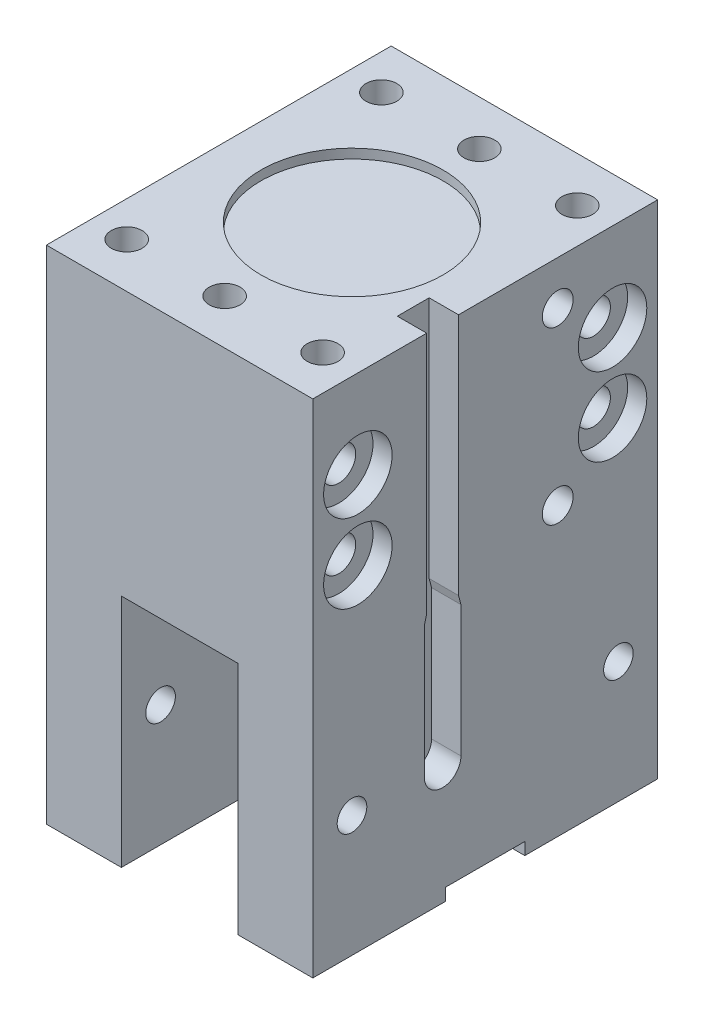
ISO-10303-21;
HEADER;
FILE_DESCRIPTION(('STEP AP214'),'2;1');
FILE_NAME('part.step','',(''),(''),'','','');
FILE_SCHEMA(('AUTOMOTIVE_DESIGN { 1 0 10303 214 1 1 1 1 }'));
ENDSEC;
DATA;
#1=APPLICATION_CONTEXT('core data for automotive mechanical design processes');
#2=APPLICATION_PROTOCOL_DEFINITION('international standard','automotive_design',2000,#1);
#3=PRODUCT_CONTEXT('',#1,'mechanical');
#4=PRODUCT('Part','Part','',(#3));
#5=PRODUCT_RELATED_PRODUCT_CATEGORY('part','',(#4));
#6=PRODUCT_DEFINITION_FORMATION('','',#4);
#7=PRODUCT_DEFINITION_CONTEXT('part definition',#1,'design');
#8=PRODUCT_DEFINITION('design','',#6,#7);
#9=PRODUCT_DEFINITION_SHAPE('','',#8);
#10=(LENGTH_UNIT() NAMED_UNIT(*) SI_UNIT(.MILLI.,.METRE.));
#11=(NAMED_UNIT(*) PLANE_ANGLE_UNIT() SI_UNIT($,.RADIAN.));
#12=(NAMED_UNIT(*) SI_UNIT($,.STERADIAN.) SOLID_ANGLE_UNIT());
#13=UNCERTAINTY_MEASURE_WITH_UNIT(LENGTH_MEASURE(1.E-05),#10,'distance_accuracy_value','');
#14=(GEOMETRIC_REPRESENTATION_CONTEXT(3) GLOBAL_UNCERTAINTY_ASSIGNED_CONTEXT((#13)) GLOBAL_UNIT_ASSIGNED_CONTEXT((#10,
#11,#12)) REPRESENTATION_CONTEXT('',''));
#15=CARTESIAN_POINT('',(0.,0.,0.));
#16=DIRECTION('',(0.,0.,1.));
#17=DIRECTION('',(1.,0.,0.));
#18=AXIS2_PLACEMENT_3D('',#15,#16,#17);
#19=CARTESIAN_POINT('',(-21.59,-40.64,27.94));
#20=DIRECTION('',(0.,1.,0.));
#21=DIRECTION('',(0.,0.,1.));
#22=AXIS2_PLACEMENT_3D('',#19,#20,#21);
#23=PLANE('',#22);
#24=DIRECTION('',(0.,0.,1.));
#25=VECTOR('',#24,1.);
#26=CARTESIAN_POINT('',(-21.59,-40.64,-27.94));
#27=LINE('',#26,#25);
#28=CARTESIAN_POINT('',(-21.59,-40.64,6.4135));
#29=VERTEX_POINT('',#28);
#30=CARTESIAN_POINT('',(-21.59,-40.64,27.94));
#31=VERTEX_POINT('',#30);
#32=EDGE_CURVE('E529',#29,#31,#27,.T.);
#33=ORIENTED_EDGE('',*,*,#32,.F.);
#34=DIRECTION('',(1.,0.,0.));
#35=VECTOR('',#34,1.);
#36=CARTESIAN_POINT('',(-21.59,-40.64,6.4135));
#37=LINE('',#36,#35);
#38=CARTESIAN_POINT('',(-9.4361,-40.64,6.4135));
#39=VERTEX_POINT('',#38);
#40=EDGE_CURVE('E267',#29,#39,#37,.T.);
#41=ORIENTED_EDGE('',*,*,#40,.T.);
#42=DIRECTION('',(0.,0.,1.));
#43=VECTOR('',#42,1.);
#44=CARTESIAN_POINT('',(-9.4361,-40.64,-27.94));
#45=LINE('',#44,#43);
#46=CARTESIAN_POINT('',(-9.4361,-40.64,27.94));
#47=VERTEX_POINT('',#46);
#48=EDGE_CURVE('E288',#39,#47,#45,.T.);
#49=ORIENTED_EDGE('',*,*,#48,.T.);
#50=DIRECTION('',(1.,0.,0.));
#51=VECTOR('',#50,1.);
#52=CARTESIAN_POINT('',(-21.59,-40.64,27.94));
#53=LINE('',#52,#51);
#54=EDGE_CURVE('E547',#31,#47,#53,.T.);
#55=ORIENTED_EDGE('',*,*,#54,.F.);
#56=EDGE_LOOP('',(#33,#41,#49,#55));
#57=FACE_BOUND('',#56,.T.);
#58=ADVANCED_FACE('F37',(#57),#23,.F.);
#59=DIRECTION('',(0.,0.,1.));
#60=VECTOR('',#59,1.);
#61=CARTESIAN_POINT('',(9.4361,-40.64,-27.94));
#62=LINE('',#61,#60);
#63=CARTESIAN_POINT('',(9.4361,-40.64,6.4135));
#64=VERTEX_POINT('',#63);
#65=CARTESIAN_POINT('',(9.4361,-40.64,27.94));
#66=VERTEX_POINT('',#65);
#67=EDGE_CURVE('E304',#64,#66,#62,.T.);
#68=ORIENTED_EDGE('',*,*,#67,.F.);
#69=CARTESIAN_POINT('',(21.59,-40.64,6.4135));
#70=VERTEX_POINT('',#69);
#71=EDGE_CURVE('E251',#64,#70,#37,.T.);
#72=ORIENTED_EDGE('',*,*,#71,.T.);
#73=DIRECTION('',(0.,0.,-1.));
#74=VECTOR('',#73,1.);
#75=CARTESIAN_POINT('',(21.59,-40.64,-27.94));
#76=LINE('',#75,#74);
#77=CARTESIAN_POINT('',(21.59,-40.64,27.94));
#78=VERTEX_POINT('',#77);
#79=EDGE_CURVE('E551',#78,#70,#76,.T.);
#80=ORIENTED_EDGE('',*,*,#79,.F.);
#81=EDGE_CURVE('E546',#66,#78,#53,.T.);
#82=ORIENTED_EDGE('',*,*,#81,.F.);
#83=EDGE_LOOP('',(#68,#72,#80,#82));
#84=FACE_BOUND('',#83,.T.);
#85=ADVANCED_FACE('F597',(#84),#23,.F.);
#86=CARTESIAN_POINT('',(-9.4361,-40.64,-27.94));
#87=VERTEX_POINT('',#86);
#88=CARTESIAN_POINT('',(-9.4361,-40.64,-6.41350000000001));
#89=VERTEX_POINT('',#88);
#90=EDGE_CURVE('E305',#87,#89,#45,.T.);
#91=ORIENTED_EDGE('',*,*,#90,.T.);
#92=DIRECTION('',(1.,0.,0.));
#93=VECTOR('',#92,1.);
#94=CARTESIAN_POINT('',(-21.59,-40.64,-6.4135));
#95=LINE('',#94,#93);
#96=CARTESIAN_POINT('',(-21.59,-40.64,-6.4135));
#97=VERTEX_POINT('',#96);
#98=EDGE_CURVE('E52',#97,#89,#95,.T.);
#99=ORIENTED_EDGE('',*,*,#98,.F.);
#100=CARTESIAN_POINT('',(-21.59,-40.64,-27.94));
#101=VERTEX_POINT('',#100);
#102=EDGE_CURVE('E543',#101,#97,#27,.T.);
#103=ORIENTED_EDGE('',*,*,#102,.F.);
#104=DIRECTION('',(-1.,0.,0.));
#105=VECTOR('',#104,1.);
#106=CARTESIAN_POINT('',(-21.59,-40.64,-27.94));
#107=LINE('',#106,#105);
#108=EDGE_CURVE('E554',#87,#101,#107,.T.);
#109=ORIENTED_EDGE('',*,*,#108,.F.);
#110=EDGE_LOOP('',(#91,#99,#103,#109));
#111=FACE_BOUND('',#110,.T.);
#112=ADVANCED_FACE('F680',(#111),#23,.F.);
#113=CARTESIAN_POINT('',(-21.59,-20.9804,-21.59));
#114=DIRECTION('',(1.,0.,0.));
#115=DIRECTION('',(0.,0.,-1.));
#116=AXIS2_PLACEMENT_3D('',#113,#114,#115);
#117=CYLINDRICAL_SURFACE('',#116,2.4);
#118=CARTESIAN_POINT('',(-9.4361,-20.9804,-21.59));
#119=DIRECTION('',(-1.,0.,0.));
#120=DIRECTION('',(0.,0.,1.));
#121=AXIS2_PLACEMENT_3D('',#118,#119,#120);
#122=CIRCLE('',#121,2.4);
#123=CARTESIAN_POINT('',(-9.4361,-20.9804,-19.19));
#124=VERTEX_POINT('',#123);
#125=EDGE_CURVE('E312',#124,#124,#122,.F.);
#126=ORIENTED_EDGE('',*,*,#125,.T.);
#127=EDGE_LOOP('',(#126));
#128=FACE_BOUND('',#127,.T.);
#129=CARTESIAN_POINT('',(-21.59,-20.9804,-21.59));
#130=DIRECTION('',(1.,0.,0.));
#131=DIRECTION('',(0.,0.,-1.));
#132=AXIS2_PLACEMENT_3D('',#129,#130,#131);
#133=CIRCLE('',#132,2.4);
#134=CARTESIAN_POINT('',(-21.59,-20.9804,-23.99));
#135=VERTEX_POINT('',#134);
#136=EDGE_CURVE('E382',#135,#135,#133,.T.);
#137=ORIENTED_EDGE('',*,*,#136,.F.);
#138=EDGE_LOOP('',(#137));
#139=FACE_BOUND('',#138,.T.);
#140=ADVANCED_FACE('F694',(#128,#139),#117,.F.);
#141=CARTESIAN_POINT('',(-21.59,-20.9804,21.59));
#142=DIRECTION('',(1.,0.,0.));
#143=DIRECTION('',(0.,0.,-1.));
#144=AXIS2_PLACEMENT_3D('',#141,#142,#143);
#145=CYLINDRICAL_SURFACE('',#144,2.4);
#146=CARTESIAN_POINT('',(-9.4361,-20.9804,21.59));
#147=DIRECTION('',(-1.,0.,0.));
#148=DIRECTION('',(0.,0.,1.));
#149=AXIS2_PLACEMENT_3D('',#146,#147,#148);
#150=CIRCLE('',#149,2.4);
#151=CARTESIAN_POINT('',(-9.4361,-20.9804,23.99));
#152=VERTEX_POINT('',#151);
#153=EDGE_CURVE('E311',#152,#152,#150,.F.);
#154=ORIENTED_EDGE('',*,*,#153,.T.);
#155=EDGE_LOOP('',(#154));
#156=FACE_BOUND('',#155,.T.);
#157=CARTESIAN_POINT('',(-21.59,-20.9804,21.59));
#158=DIRECTION('',(1.,0.,0.));
#159=DIRECTION('',(0.,0.,-1.));
#160=AXIS2_PLACEMENT_3D('',#157,#158,#159);
#161=CIRCLE('',#160,2.4);
#162=CARTESIAN_POINT('',(-21.59,-20.9804,19.19));
#163=VERTEX_POINT('',#162);
#164=EDGE_CURVE('E376',#163,#163,#161,.T.);
#165=ORIENTED_EDGE('',*,*,#164,.F.);
#166=EDGE_LOOP('',(#165));
#167=FACE_BOUND('',#166,.T.);
#168=ADVANCED_FACE('F699',(#156,#167),#145,.F.);
#169=CARTESIAN_POINT('',(-21.59,40.64,-27.94));
#170=DIRECTION('',(1.,0.,0.));
#171=DIRECTION('',(0.,0.,-1.));
#172=AXIS2_PLACEMENT_3D('',#169,#170,#171);
#173=PLANE('',#172);
#174=ORIENTED_EDGE('',*,*,#164,.T.);
#175=EDGE_LOOP('',(#174));
#176=FACE_BOUND('',#175,.T.);
#177=ORIENTED_EDGE('',*,*,#136,.T.);
#178=EDGE_LOOP('',(#177));
#179=FACE_BOUND('',#178,.T.);
#180=CARTESIAN_POINT('',(-21.59,20.0025,20.6375));
#181=DIRECTION('',(-1.,0.,0.));
#182=DIRECTION('',(0.,0.,1.));
#183=AXIS2_PLACEMENT_3D('',#180,#181,#182);
#184=CIRCLE('',#183,2.5);
#185=CARTESIAN_POINT('',(-21.59,20.0025,23.1375));
#186=VERTEX_POINT('',#185);
#187=EDGE_CURVE('E385',#186,#186,#184,.T.);
#188=ORIENTED_EDGE('',*,*,#187,.F.);
#189=EDGE_LOOP('',(#188));
#190=FACE_BOUND('',#189,.T.);
#191=CARTESIAN_POINT('',(-21.59,20.0025,-20.6375));
#192=DIRECTION('',(-1.,0.,0.));
#193=DIRECTION('',(0.,0.,1.));
#194=AXIS2_PLACEMENT_3D('',#191,#192,#193);
#195=CIRCLE('',#194,2.5);
#196=CARTESIAN_POINT('',(-21.59,20.0025,-18.1375));
#197=VERTEX_POINT('',#196);
#198=EDGE_CURVE('E391',#197,#197,#195,.T.);
#199=ORIENTED_EDGE('',*,*,#198,.F.);
#200=EDGE_LOOP('',(#199));
#201=FACE_BOUND('',#200,.T.);
#202=CARTESIAN_POINT('',(-21.59,26.3525,-20.6375));
#203=DIRECTION('',(-1.,0.,0.));
#204=DIRECTION('',(0.,0.,1.));
#205=AXIS2_PLACEMENT_3D('',#202,#203,#204);
#206=CIRCLE('',#205,2.5);
#207=CARTESIAN_POINT('',(-21.59,26.3525,-18.1375));
#208=VERTEX_POINT('',#207);
#209=EDGE_CURVE('E451',#208,#208,#206,.T.);
#210=ORIENTED_EDGE('',*,*,#209,.F.);
#211=EDGE_LOOP('',(#210));
#212=FACE_BOUND('',#211,.T.);
#213=CARTESIAN_POINT('',(-21.59,26.3525,20.6375));
#214=DIRECTION('',(-1.,0.,0.));
#215=DIRECTION('',(0.,0.,1.));
#216=AXIS2_PLACEMENT_3D('',#213,#214,#215);
#217=CIRCLE('',#216,2.5);
#218=CARTESIAN_POINT('',(-21.59,26.3525,23.1375));
#219=VERTEX_POINT('',#218);
#220=EDGE_CURVE('E454',#219,#219,#217,.T.);
#221=ORIENTED_EDGE('',*,*,#220,.F.);
#222=EDGE_LOOP('',(#221));
#223=FACE_BOUND('',#222,.T.);
#224=CARTESIAN_POINT('',(-21.59,13.6525,20.6375));
#225=DIRECTION('',(-1.,0.,0.));
#226=DIRECTION('',(0.,0.,1.));
#227=AXIS2_PLACEMENT_3D('',#224,#225,#226);
#228=CIRCLE('',#227,2.5);
#229=CARTESIAN_POINT('',(-21.59,13.6525,23.1375));
#230=VERTEX_POINT('',#229);
#231=EDGE_CURVE('E457',#230,#230,#228,.T.);
#232=ORIENTED_EDGE('',*,*,#231,.F.);
#233=EDGE_LOOP('',(#232));
#234=FACE_BOUND('',#233,.T.);
#235=CARTESIAN_POINT('',(-21.59,13.6525,-20.6375));
#236=DIRECTION('',(-1.,0.,0.));
#237=DIRECTION('',(0.,0.,1.));
#238=AXIS2_PLACEMENT_3D('',#235,#236,#237);
#239=CIRCLE('',#238,2.5);
#240=CARTESIAN_POINT('',(-21.59,13.6525,-18.1375));
#241=VERTEX_POINT('',#240);
#242=EDGE_CURVE('E460',#241,#241,#239,.T.);
#243=ORIENTED_EDGE('',*,*,#242,.F.);
#244=EDGE_LOOP('',(#243));
#245=FACE_BOUND('',#244,.T.);
#246=DIRECTION('',(0.,0.,1.));
#247=VECTOR('',#246,1.);
#248=CARTESIAN_POINT('',(-21.59,-38.655625,6.4135));
#249=LINE('',#248,#247);
#250=CARTESIAN_POINT('',(-21.59,-38.655625,-6.4135));
#251=VERTEX_POINT('',#250);
#252=CARTESIAN_POINT('',(-21.59,-38.655625,6.4135));
#253=VERTEX_POINT('',#252);
#254=EDGE_CURVE('E248',#251,#253,#249,.T.);
#255=ORIENTED_EDGE('',*,*,#254,.T.);
#256=DIRECTION('',(0.,-1.,0.));
#257=VECTOR('',#256,1.);
#258=CARTESIAN_POINT('',(-21.59,-40.64,6.4135));
#259=LINE('',#258,#257);
#260=EDGE_CURVE('E241',#253,#29,#259,.T.);
#261=ORIENTED_EDGE('',*,*,#260,.T.);
#262=ORIENTED_EDGE('',*,*,#32,.T.);
#263=DIRECTION('',(0.,-1.,0.));
#264=VECTOR('',#263,1.);
#265=CARTESIAN_POINT('',(-21.59,40.64,27.94));
#266=LINE('',#265,#264);
#267=CARTESIAN_POINT('',(-21.59,40.64,27.94));
#268=VERTEX_POINT('',#267);
#269=EDGE_CURVE('E565',#268,#31,#266,.T.);
#270=ORIENTED_EDGE('',*,*,#269,.F.);
#271=DIRECTION('',(0.,0.,1.));
#272=VECTOR('',#271,1.);
#273=CARTESIAN_POINT('',(-21.59,40.64,-27.94));
#274=LINE('',#273,#272);
#275=CARTESIAN_POINT('',(-21.59,40.64,-27.94));
#276=VERTEX_POINT('',#275);
#277=EDGE_CURVE('E530',#276,#268,#274,.T.);
#278=ORIENTED_EDGE('',*,*,#277,.F.);
#279=DIRECTION('',(0.,-1.,0.));
#280=VECTOR('',#279,1.);
#281=CARTESIAN_POINT('',(-21.59,40.64,-27.94));
#282=LINE('',#281,#280);
#283=EDGE_CURVE('E542',#276,#101,#282,.T.);
#284=ORIENTED_EDGE('',*,*,#283,.T.);
#285=ORIENTED_EDGE('',*,*,#102,.T.);
#286=DIRECTION('',(0.,1.,0.));
#287=VECTOR('',#286,1.);
#288=CARTESIAN_POINT('',(-21.59,-40.64,-6.4135));
#289=LINE('',#288,#287);
#290=EDGE_CURVE('E244',#97,#251,#289,.T.);
#291=ORIENTED_EDGE('',*,*,#290,.T.);
#292=EDGE_LOOP('',(#255,#261,#262,#270,#278,#284,#285,#291));
#293=FACE_BOUND('',#292,.T.);
#294=ADVANCED_FACE('F39',(#176,#179,#190,#201,#212,#223,#234,#245,#293),#173,.F.);
#295=CARTESIAN_POINT('',(-21.59,40.64,27.94));
#296=DIRECTION('',(0.,0.,-1.));
#297=DIRECTION('',(-1.,0.,0.));
#298=AXIS2_PLACEMENT_3D('',#295,#296,#297);
#299=PLANE('',#298);
#300=ORIENTED_EDGE('',*,*,#54,.T.);
#301=DIRECTION('',(0.,-1.,0.));
#302=VECTOR('',#301,1.);
#303=CARTESIAN_POINT('',(-9.4361,-40.64,27.94));
#304=LINE('',#303,#302);
#305=CARTESIAN_POINT('',(-9.4361,-2.53999999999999,27.94));
#306=VERTEX_POINT('',#305);
#307=EDGE_CURVE('E277',#306,#47,#304,.T.);
#308=ORIENTED_EDGE('',*,*,#307,.F.);
#309=DIRECTION('',(-1.,0.,0.));
#310=VECTOR('',#309,1.);
#311=CARTESIAN_POINT('',(-9.4361,-2.53999999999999,27.94));
#312=LINE('',#311,#310);
#313=CARTESIAN_POINT('',(9.4361,-2.53999999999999,27.94));
#314=VERTEX_POINT('',#313);
#315=EDGE_CURVE('E282',#314,#306,#312,.T.);
#316=ORIENTED_EDGE('',*,*,#315,.F.);
#317=DIRECTION('',(0.,1.,0.));
#318=VECTOR('',#317,1.);
#319=CARTESIAN_POINT('',(9.4361,-40.64,27.94));
#320=LINE('',#319,#318);
#321=EDGE_CURVE('E291',#66,#314,#320,.T.);
#322=ORIENTED_EDGE('',*,*,#321,.F.);
#323=ORIENTED_EDGE('',*,*,#81,.T.);
#324=DIRECTION('',(0.,-1.,0.));
#325=VECTOR('',#324,1.);
#326=CARTESIAN_POINT('',(21.59,40.64,27.94));
#327=LINE('',#326,#325);
#328=CARTESIAN_POINT('',(21.59,40.64,27.94));
#329=VERTEX_POINT('',#328);
#330=EDGE_CURVE('E562',#329,#78,#327,.T.);
#331=ORIENTED_EDGE('',*,*,#330,.F.);
#332=DIRECTION('',(1.,0.,0.));
#333=VECTOR('',#332,1.);
#334=CARTESIAN_POINT('',(-21.59,40.64,27.94));
#335=LINE('',#334,#333);
#336=EDGE_CURVE('E533',#268,#329,#335,.T.);
#337=ORIENTED_EDGE('',*,*,#336,.F.);
#338=ORIENTED_EDGE('',*,*,#269,.T.);
#339=EDGE_LOOP('',(#300,#308,#316,#322,#323,#331,#337,#338));
#340=FACE_BOUND('',#339,.T.);
#341=ADVANCED_FACE('F605',(#340),#299,.F.);
#342=CARTESIAN_POINT('',(21.59,40.64,-27.94));
#343=DIRECTION('',(-1.,0.,0.));
#344=DIRECTION('',(0.,0.,1.));
#345=AXIS2_PLACEMENT_3D('',#342,#343,#344);
#346=PLANE('',#345);
#347=CARTESIAN_POINT('',(21.59,-20.9804,21.59));
#348=DIRECTION('',(1.,0.,0.));
#349=DIRECTION('',(0.,0.,-1.));
#350=AXIS2_PLACEMENT_3D('',#347,#348,#349);
#351=CIRCLE('',#350,2.4);
#352=CARTESIAN_POINT('',(21.59,-20.9804,19.19));
#353=VERTEX_POINT('',#352);
#354=EDGE_CURVE('E361',#353,#353,#351,.T.);
#355=ORIENTED_EDGE('',*,*,#354,.F.);
#356=EDGE_LOOP('',(#355));
#357=FACE_BOUND('',#356,.T.);
#358=CARTESIAN_POINT('',(21.59,-20.9804,-21.59));
#359=DIRECTION('',(1.,0.,0.));
#360=DIRECTION('',(0.,0.,-1.));
#361=AXIS2_PLACEMENT_3D('',#358,#359,#360);
#362=CIRCLE('',#361,2.4);
#363=CARTESIAN_POINT('',(21.59,-20.9804,-23.99));
#364=VERTEX_POINT('',#363);
#365=EDGE_CURVE('E379',#364,#364,#362,.T.);
#366=ORIENTED_EDGE('',*,*,#365,.F.);
#367=EDGE_LOOP('',(#366));
#368=FACE_BOUND('',#367,.T.);
#369=CARTESIAN_POINT('',(21.59,13.6525,20.6375));
#370=DIRECTION('',(1.,0.,0.));
#371=DIRECTION('',(0.,0.,-1.));
#372=AXIS2_PLACEMENT_3D('',#369,#370,#371);
#373=CIRCLE('',#372,5.55);
#374=CARTESIAN_POINT('',(21.59,13.6525,15.0875));
#375=VERTEX_POINT('',#374);
#376=EDGE_CURVE('E408',#375,#375,#373,.T.);
#377=ORIENTED_EDGE('',*,*,#376,.F.);
#378=EDGE_LOOP('',(#377));
#379=FACE_BOUND('',#378,.T.);
#380=CARTESIAN_POINT('',(21.59,26.3525,-20.6375));
#381=DIRECTION('',(1.,0.,0.));
#382=DIRECTION('',(0.,0.,-1.));
#383=AXIS2_PLACEMENT_3D('',#380,#381,#382);
#384=CIRCLE('',#383,5.55);
#385=CARTESIAN_POINT('',(21.59,26.3525,-26.1875));
#386=VERTEX_POINT('',#385);
#387=EDGE_CURVE('E421',#386,#386,#384,.T.);
#388=ORIENTED_EDGE('',*,*,#387,.F.);
#389=EDGE_LOOP('',(#388));
#390=FACE_BOUND('',#389,.T.);
#391=CARTESIAN_POINT('',(21.59,13.6525,-20.6375));
#392=DIRECTION('',(1.,0.,0.));
#393=DIRECTION('',(0.,0.,-1.));
#394=AXIS2_PLACEMENT_3D('',#391,#392,#393);
#395=CIRCLE('',#394,5.55);
#396=CARTESIAN_POINT('',(21.59,13.6525,-26.1875));
#397=VERTEX_POINT('',#396);
#398=EDGE_CURVE('E434',#397,#397,#395,.T.);
#399=ORIENTED_EDGE('',*,*,#398,.F.);
#400=EDGE_LOOP('',(#399));
#401=FACE_BOUND('',#400,.T.);
#402=CARTESIAN_POINT('',(21.59,26.3525,20.6375));
#403=DIRECTION('',(1.,0.,0.));
#404=DIRECTION('',(0.,0.,-1.));
#405=AXIS2_PLACEMENT_3D('',#402,#403,#404);
#406=CIRCLE('',#405,5.55);
#407=CARTESIAN_POINT('',(21.59,26.3525,15.0875));
#408=VERTEX_POINT('',#407);
#409=EDGE_CURVE('E447',#408,#408,#406,.T.);
#410=ORIENTED_EDGE('',*,*,#409,.F.);
#411=EDGE_LOOP('',(#410));
#412=FACE_BOUND('',#411,.T.);
#413=CARTESIAN_POINT('',(21.59,33.528,-11.7475));
#414=DIRECTION('',(1.,0.,0.));
#415=DIRECTION('',(0.,0.,-1.));
#416=AXIS2_PLACEMENT_3D('',#413,#414,#415);
#417=CIRCLE('',#416,2.5);
#418=CARTESIAN_POINT('',(21.59,33.528,-14.2475));
#419=VERTEX_POINT('',#418);
#420=EDGE_CURVE('E472',#419,#419,#417,.T.);
#421=ORIENTED_EDGE('',*,*,#420,.F.);
#422=EDGE_LOOP('',(#421));
#423=FACE_BOUND('',#422,.T.);
#424=CARTESIAN_POINT('',(21.59,5.842,-11.7475));
#425=DIRECTION('',(1.,0.,0.));
#426=DIRECTION('',(0.,0.,-1.));
#427=AXIS2_PLACEMENT_3D('',#424,#425,#426);
#428=CIRCLE('',#427,2.5);
#429=CARTESIAN_POINT('',(21.59,5.842,-14.2475));
#430=VERTEX_POINT('',#429);
#431=EDGE_CURVE('E484',#430,#430,#428,.T.);
#432=ORIENTED_EDGE('',*,*,#431,.F.);
#433=EDGE_LOOP('',(#432));
#434=FACE_BOUND('',#433,.T.);
#435=ORIENTED_EDGE('',*,*,#79,.T.);
#436=DIRECTION('',(0.,-1.,0.));
#437=VECTOR('',#436,1.);
#438=CARTESIAN_POINT('',(21.59,-40.64,6.4135));
#439=LINE('',#438,#437);
#440=CARTESIAN_POINT('',(21.59,-38.655625,6.4135));
#441=VERTEX_POINT('',#440);
#442=EDGE_CURVE('E240',#441,#70,#439,.T.);
#443=ORIENTED_EDGE('',*,*,#442,.F.);
#444=DIRECTION('',(0.,0.,1.));
#445=VECTOR('',#444,1.);
#446=CARTESIAN_POINT('',(21.59,-38.655625,6.4135));
#447=LINE('',#446,#445);
#448=CARTESIAN_POINT('',(21.59,-38.655625,-6.4135));
#449=VERTEX_POINT('',#448);
#450=EDGE_CURVE('E245',#449,#441,#447,.T.);
#451=ORIENTED_EDGE('',*,*,#450,.F.);
#452=DIRECTION('',(0.,1.,0.));
#453=VECTOR('',#452,1.);
#454=CARTESIAN_POINT('',(21.59,-40.64,-6.4135));
#455=LINE('',#454,#453);
#456=CARTESIAN_POINT('',(21.59,-40.64,-6.4135));
#457=VERTEX_POINT('',#456);
#458=EDGE_CURVE('E253',#457,#449,#455,.T.);
#459=ORIENTED_EDGE('',*,*,#458,.F.);
#460=CARTESIAN_POINT('',(21.59,-40.64,-27.94));
#461=VERTEX_POINT('',#460);
#462=EDGE_CURVE('E550',#457,#461,#76,.T.);
#463=ORIENTED_EDGE('',*,*,#462,.T.);
#464=DIRECTION('',(0.,-1.,0.));
#465=VECTOR('',#464,1.);
#466=CARTESIAN_POINT('',(21.59,40.64,-27.94));
#467=LINE('',#466,#465);
#468=CARTESIAN_POINT('',(21.59,40.64,-27.94));
#469=VERTEX_POINT('',#468);
#470=EDGE_CURVE('E559',#469,#461,#467,.T.);
#471=ORIENTED_EDGE('',*,*,#470,.F.);
#472=DIRECTION('',(0.,0.,-1.));
#473=VECTOR('',#472,1.);
#474=CARTESIAN_POINT('',(21.59,40.64,-27.94));
#475=LINE('',#474,#473);
#476=CARTESIAN_POINT('',(21.59,40.64,4.3259375));
#477=VERTEX_POINT('',#476);
#478=EDGE_CURVE('E536',#477,#469,#475,.T.);
#479=ORIENTED_EDGE('',*,*,#478,.F.);
#480=DIRECTION('',(0.,1.,0.));
#481=VECTOR('',#480,1.);
#482=CARTESIAN_POINT('',(21.59,40.64,4.3259375));
#483=LINE('',#482,#481);
#484=CARTESIAN_POINT('',(21.59,1.246886,4.3259375));
#485=VERTEX_POINT('',#484);
#486=EDGE_CURVE('E349',#485,#477,#483,.T.);
#487=ORIENTED_EDGE('',*,*,#486,.F.);
#488=DIRECTION('',(0.,0.966860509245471,0.255305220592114));
#489=VECTOR('',#488,1.);
#490=CARTESIAN_POINT('',(21.59,1.246886,4.3259375));
#491=LINE('',#490,#489);
#492=CARTESIAN_POINT('',(21.59,-0.238074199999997,3.933825));
#493=VERTEX_POINT('',#492);
#494=EDGE_CURVE('E346',#493,#485,#491,.T.);
#495=ORIENTED_EDGE('',*,*,#494,.F.);
#496=DIRECTION('',(0.,1.,0.));
#497=VECTOR('',#496,1.);
#498=CARTESIAN_POINT('',(21.59,-21.4709502,3.933825));
#499=LINE('',#498,#497);
#500=CARTESIAN_POINT('',(21.59,-21.4709502,3.933825));
#501=VERTEX_POINT('',#500);
#502=EDGE_CURVE('E343',#501,#493,#499,.T.);
#503=ORIENTED_EDGE('',*,*,#502,.F.);
#504=CARTESIAN_POINT('',(21.59,-21.4709502,6.905625));
#505=DIRECTION('',(1.,0.,0.));
#506=DIRECTION('',(0.,0.,-1.));
#507=AXIS2_PLACEMENT_3D('',#504,#505,#506);
#508=CIRCLE('',#507,2.9718);
#509=CARTESIAN_POINT('',(21.59,-21.4709502,9.877425));
#510=VERTEX_POINT('',#509);
#511=EDGE_CURVE('E315',#510,#501,#508,.T.);
#512=ORIENTED_EDGE('',*,*,#511,.F.);
#513=DIRECTION('',(0.,-1.,0.));
#514=VECTOR('',#513,1.);
#515=CARTESIAN_POINT('',(21.59,-21.4709502,9.877425));
#516=LINE('',#515,#514);
#517=CARTESIAN_POINT('',(21.59,-0.238074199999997,9.877425));
#518=VERTEX_POINT('',#517);
#519=EDGE_CURVE('E320',#518,#510,#516,.T.);
#520=ORIENTED_EDGE('',*,*,#519,.F.);
#521=DIRECTION('',(0.,-0.966860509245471,0.255305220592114));
#522=VECTOR('',#521,1.);
#523=CARTESIAN_POINT('',(21.59,1.246886,9.48531250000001));
#524=LINE('',#523,#522);
#525=CARTESIAN_POINT('',(21.59,1.246886,9.48531250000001));
#526=VERTEX_POINT('',#525);
#527=EDGE_CURVE('E354',#526,#518,#524,.T.);
#528=ORIENTED_EDGE('',*,*,#527,.F.);
#529=DIRECTION('',(0.,-1.,0.));
#530=VECTOR('',#529,1.);
#531=CARTESIAN_POINT('',(21.59,40.64,9.4853125));
#532=LINE('',#531,#530);
#533=CARTESIAN_POINT('',(21.59,40.64,9.4853125));
#534=VERTEX_POINT('',#533);
#535=EDGE_CURVE('E351',#534,#526,#532,.T.);
#536=ORIENTED_EDGE('',*,*,#535,.F.);
#537=EDGE_CURVE('E537',#329,#534,#475,.T.);
#538=ORIENTED_EDGE('',*,*,#537,.F.);
#539=ORIENTED_EDGE('',*,*,#330,.T.);
#540=EDGE_LOOP('',(#435,#443,#451,#459,#463,#471,#479,#487,#495,#503,#512,#520,#528,#536,#538,#539));
#541=FACE_BOUND('',#540,.T.);
#542=ADVANCED_FACE('F600',(#357,#368,#379,#390,#401,#412,#423,#434,#541),#346,.F.);
#543=CARTESIAN_POINT('',(-21.59,40.64,-27.94));
#544=DIRECTION('',(0.,0.,1.));
#545=DIRECTION('',(1.,0.,0.));
#546=AXIS2_PLACEMENT_3D('',#543,#544,#545);
#547=PLANE('',#546);
#548=DIRECTION('',(-1.,0.,0.));
#549=VECTOR('',#548,1.);
#550=CARTESIAN_POINT('',(-9.4361,-2.53999999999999,-27.94));
#551=LINE('',#550,#549);
#552=CARTESIAN_POINT('',(9.4361,-2.53999999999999,-27.94));
#553=VERTEX_POINT('',#552);
#554=CARTESIAN_POINT('',(-9.4361,-2.53999999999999,-27.94));
#555=VERTEX_POINT('',#554);
#556=EDGE_CURVE('E285',#553,#555,#551,.T.);
#557=ORIENTED_EDGE('',*,*,#556,.T.);
#558=DIRECTION('',(0.,-1.,0.));
#559=VECTOR('',#558,1.);
#560=CARTESIAN_POINT('',(-9.4361,-40.64,-27.94));
#561=LINE('',#560,#559);
#562=EDGE_CURVE('E278',#555,#87,#561,.T.);
#563=ORIENTED_EDGE('',*,*,#562,.T.);
#564=ORIENTED_EDGE('',*,*,#108,.T.);
#565=ORIENTED_EDGE('',*,*,#283,.F.);
#566=DIRECTION('',(-1.,0.,0.));
#567=VECTOR('',#566,1.);
#568=CARTESIAN_POINT('',(-21.59,40.64,-27.94));
#569=LINE('',#568,#567);
#570=EDGE_CURVE('E540',#469,#276,#569,.T.);
#571=ORIENTED_EDGE('',*,*,#570,.F.);
#572=ORIENTED_EDGE('',*,*,#470,.T.);
#573=CARTESIAN_POINT('',(9.4361,-40.64,-27.94));
#574=VERTEX_POINT('',#573);
#575=EDGE_CURVE('E534',#461,#574,#107,.T.);
#576=ORIENTED_EDGE('',*,*,#575,.T.);
#577=DIRECTION('',(0.,1.,0.));
#578=VECTOR('',#577,1.);
#579=CARTESIAN_POINT('',(9.4361,-40.64,-27.94));
#580=LINE('',#579,#578);
#581=EDGE_CURVE('E281',#574,#553,#580,.T.);
#582=ORIENTED_EDGE('',*,*,#581,.T.);
#583=EDGE_LOOP('',(#557,#563,#564,#565,#571,#572,#576,#582));
#584=FACE_BOUND('',#583,.T.);
#585=ADVANCED_FACE('F615',(#584),#547,.F.);
#586=CARTESIAN_POINT('',(-21.59,40.64,27.94));
#587=DIRECTION('',(0.,1.,0.));
#588=DIRECTION('',(0.,0.,1.));
#589=AXIS2_PLACEMENT_3D('',#586,#587,#588);
#590=PLANE('',#589);
#591=DIRECTION('',(1.,0.,0.));
#592=VECTOR('',#591,1.);
#593=CARTESIAN_POINT('',(16.8275,40.64,9.4853125));
#594=LINE('',#593,#592);
#595=CARTESIAN_POINT('',(16.8275,40.64,9.4853125));
#596=VERTEX_POINT('',#595);
#597=EDGE_CURVE('E366',#596,#534,#594,.T.);
#598=ORIENTED_EDGE('',*,*,#597,.F.);
#599=DIRECTION('',(0.,0.,1.));
#600=VECTOR('',#599,1.);
#601=CARTESIAN_POINT('',(16.8275,40.64,9.4853125));
#602=LINE('',#601,#600);
#603=CARTESIAN_POINT('',(16.8275,40.64,4.3259375));
#604=VERTEX_POINT('',#603);
#605=EDGE_CURVE('E328',#604,#596,#602,.T.);
#606=ORIENTED_EDGE('',*,*,#605,.F.);
#607=DIRECTION('',(1.,0.,0.));
#608=VECTOR('',#607,1.);
#609=CARTESIAN_POINT('',(16.8275,40.64,4.3259375));
#610=LINE('',#609,#608);
#611=EDGE_CURVE('E368',#604,#477,#610,.T.);
#612=ORIENTED_EDGE('',*,*,#611,.T.);
#613=ORIENTED_EDGE('',*,*,#478,.T.);
#614=ORIENTED_EDGE('',*,*,#570,.T.);
#615=ORIENTED_EDGE('',*,*,#277,.T.);
#616=ORIENTED_EDGE('',*,*,#336,.T.);
#617=ORIENTED_EDGE('',*,*,#537,.T.);
#618=EDGE_LOOP('',(#598,#606,#612,#613,#614,#615,#616,#617));
#619=FACE_BOUND('',#618,.T.);
#620=CARTESIAN_POINT('',(0.,40.64,0.));
#621=DIRECTION('',(0.,1.,0.));
#622=DIRECTION('',(0.,0.,1.));
#623=AXIS2_PLACEMENT_3D('',#620,#621,#622);
#624=CIRCLE('',#623,14.75);
#625=CARTESIAN_POINT('',(0.,40.64,14.75));
#626=VERTEX_POINT('',#625);
#627=EDGE_CURVE('E487',#626,#626,#624,.T.);
#628=ORIENTED_EDGE('',*,*,#627,.F.);
#629=EDGE_LOOP('',(#628));
#630=FACE_BOUND('',#629,.T.);
#631=CARTESIAN_POINT('',(0.,40.64,-20.6375));
#632=DIRECTION('',(0.,1.,0.));
#633=DIRECTION('',(0.,0.,1.));
#634=AXIS2_PLACEMENT_3D('',#631,#632,#633);
#635=CIRCLE('',#634,2.5);
#636=CARTESIAN_POINT('',(0.,40.64,-18.1375));
#637=VERTEX_POINT('',#636);
#638=EDGE_CURVE('E491',#637,#637,#635,.T.);
#639=ORIENTED_EDGE('',*,*,#638,.F.);
#640=EDGE_LOOP('',(#639));
#641=FACE_BOUND('',#640,.T.);
#642=CARTESIAN_POINT('',(0.,40.64,20.6375));
#643=DIRECTION('',(0.,1.,0.));
#644=DIRECTION('',(0.,0.,1.));
#645=AXIS2_PLACEMENT_3D('',#642,#643,#644);
#646=CIRCLE('',#645,2.5);
#647=CARTESIAN_POINT('',(0.,40.64,23.1375));
#648=VERTEX_POINT('',#647);
#649=EDGE_CURVE('E497',#648,#648,#646,.T.);
#650=ORIENTED_EDGE('',*,*,#649,.F.);
#651=EDGE_LOOP('',(#650));
#652=FACE_BOUND('',#651,.T.);
#653=CARTESIAN_POINT('',(15.875,40.64,-20.6375));
#654=DIRECTION('',(0.,1.,0.));
#655=DIRECTION('',(0.,0.,1.));
#656=AXIS2_PLACEMENT_3D('',#653,#654,#655);
#657=CIRCLE('',#656,2.5);
#658=CARTESIAN_POINT('',(15.875,40.64,-18.1375));
#659=VERTEX_POINT('',#658);
#660=EDGE_CURVE('E508',#659,#659,#657,.T.);
#661=ORIENTED_EDGE('',*,*,#660,.F.);
#662=EDGE_LOOP('',(#661));
#663=FACE_BOUND('',#662,.T.);
#664=CARTESIAN_POINT('',(15.875,40.64,20.6375));
#665=DIRECTION('',(0.,1.,0.));
#666=DIRECTION('',(0.,0.,1.));
#667=AXIS2_PLACEMENT_3D('',#664,#665,#666);
#668=CIRCLE('',#667,2.5);
#669=CARTESIAN_POINT('',(15.875,40.64,23.1375));
#670=VERTEX_POINT('',#669);
#671=EDGE_CURVE('E514',#670,#670,#668,.T.);
#672=ORIENTED_EDGE('',*,*,#671,.F.);
#673=EDGE_LOOP('',(#672));
#674=FACE_BOUND('',#673,.T.);
#675=CARTESIAN_POINT('',(-15.875,40.64,20.6375));
#676=DIRECTION('',(0.,1.,0.));
#677=DIRECTION('',(0.,0.,1.));
#678=AXIS2_PLACEMENT_3D('',#675,#676,#677);
#679=CIRCLE('',#678,2.5);
#680=CARTESIAN_POINT('',(-15.875,40.64,23.1375));
#681=VERTEX_POINT('',#680);
#682=EDGE_CURVE('E520',#681,#681,#679,.T.);
#683=ORIENTED_EDGE('',*,*,#682,.F.);
#684=EDGE_LOOP('',(#683));
#685=FACE_BOUND('',#684,.T.);
#686=CARTESIAN_POINT('',(-15.875,40.64,-20.6375));
#687=DIRECTION('',(0.,1.,0.));
#688=DIRECTION('',(0.,0.,1.));
#689=AXIS2_PLACEMENT_3D('',#686,#687,#688);
#690=CIRCLE('',#689,2.5);
#691=CARTESIAN_POINT('',(-15.875,40.64,-18.1375));
#692=VERTEX_POINT('',#691);
#693=EDGE_CURVE('E526',#692,#692,#690,.T.);
#694=ORIENTED_EDGE('',*,*,#693,.F.);
#695=EDGE_LOOP('',(#694));
#696=FACE_BOUND('',#695,.T.);
#697=ADVANCED_FACE('F631',(#619,#630,#641,#652,#663,#674,#685,#696),#590,.T.);
#698=ORIENTED_EDGE('',*,*,#462,.F.);
#699=CARTESIAN_POINT('',(9.4361,-40.64,-6.4135));
#700=VERTEX_POINT('',#699);
#701=EDGE_CURVE('E266',#700,#457,#95,.T.);
#702=ORIENTED_EDGE('',*,*,#701,.F.);
#703=EDGE_CURVE('E301',#574,#700,#62,.T.);
#704=ORIENTED_EDGE('',*,*,#703,.F.);
#705=ORIENTED_EDGE('',*,*,#575,.F.);
#706=EDGE_LOOP('',(#698,#702,#704,#705));
#707=FACE_BOUND('',#706,.T.);
#708=ADVANCED_FACE('F621',(#707),#23,.F.);
#709=CARTESIAN_POINT('',(-15.875,40.64,-20.6375));
#710=DIRECTION('',(0.,1.,0.));
#711=DIRECTION('',(0.,0.,1.));
#712=AXIS2_PLACEMENT_3D('',#709,#710,#711);
#713=CYLINDRICAL_SURFACE('',#712,2.5);
#714=CARTESIAN_POINT('',(-15.875,31.64,-20.6375));
#715=DIRECTION('',(0.,1.,0.));
#716=DIRECTION('',(0.,0.,1.));
#717=AXIS2_PLACEMENT_3D('',#714,#715,#716);
#718=CIRCLE('',#717,2.5);
#719=CARTESIAN_POINT('',(-15.875,31.64,-18.1375));
#720=VERTEX_POINT('',#719);
#721=EDGE_CURVE('E523',#720,#720,#718,.T.);
#722=ORIENTED_EDGE('',*,*,#721,.F.);
#723=EDGE_LOOP('',(#722));
#724=FACE_BOUND('',#723,.T.);
#725=ORIENTED_EDGE('',*,*,#693,.T.);
#726=EDGE_LOOP('',(#725));
#727=FACE_BOUND('',#726,.T.);
#728=ADVANCED_FACE('F685',(#724,#727),#713,.F.);
#729=CARTESIAN_POINT('',(-15.875,31.64,-20.6375));
#730=DIRECTION('',(0.,1.,0.));
#731=DIRECTION('',(0.,0.,1.));
#732=AXIS2_PLACEMENT_3D('',#729,#730,#731);
#733=CONICAL_SURFACE('',#732,2.5,1.02974425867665);
#734=CARTESIAN_POINT('',(-15.875,30.1378484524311,-20.6375));
#735=VERTEX_POINT('',#734);
#736=VERTEX_LOOP('',#735);
#737=FACE_BOUND('',#736,.T.);
#738=ORIENTED_EDGE('',*,*,#721,.T.);
#739=EDGE_LOOP('',(#738));
#740=FACE_BOUND('',#739,.T.);
#741=ADVANCED_FACE('F690',(#737,#740),#733,.F.);
#742=CARTESIAN_POINT('',(-15.875,40.64,20.6375));
#743=DIRECTION('',(0.,1.,0.));
#744=DIRECTION('',(0.,0.,1.));
#745=AXIS2_PLACEMENT_3D('',#742,#743,#744);
#746=CYLINDRICAL_SURFACE('',#745,2.5);
#747=CARTESIAN_POINT('',(-15.875,31.64,20.6375));
#748=DIRECTION('',(0.,1.,0.));
#749=DIRECTION('',(0.,0.,1.));
#750=AXIS2_PLACEMENT_3D('',#747,#748,#749);
#751=CIRCLE('',#750,2.5);
#752=CARTESIAN_POINT('',(-15.875,31.64,23.1375));
#753=VERTEX_POINT('',#752);
#754=EDGE_CURVE('E517',#753,#753,#751,.T.);
#755=ORIENTED_EDGE('',*,*,#754,.F.);
#756=EDGE_LOOP('',(#755));
#757=FACE_BOUND('',#756,.T.);
#758=ORIENTED_EDGE('',*,*,#682,.T.);
#759=EDGE_LOOP('',(#758));
#760=FACE_BOUND('',#759,.T.);
#761=ADVANCED_FACE('F834',(#757,#760),#746,.F.);
#762=CARTESIAN_POINT('',(-15.875,31.64,20.6375));
#763=DIRECTION('',(0.,1.,0.));
#764=DIRECTION('',(0.,0.,1.));
#765=AXIS2_PLACEMENT_3D('',#762,#763,#764);
#766=CONICAL_SURFACE('',#765,2.5,1.02974425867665);
#767=CARTESIAN_POINT('',(-15.875,30.1378484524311,20.6375));
#768=VERTEX_POINT('',#767);
#769=VERTEX_LOOP('',#768);
#770=FACE_BOUND('',#769,.T.);
#771=ORIENTED_EDGE('',*,*,#754,.T.);
#772=EDGE_LOOP('',(#771));
#773=FACE_BOUND('',#772,.T.);
#774=ADVANCED_FACE('F826',(#770,#773),#766,.F.);
#775=CARTESIAN_POINT('',(15.875,40.64,20.6375));
#776=DIRECTION('',(0.,1.,0.));
#777=DIRECTION('',(0.,0.,1.));
#778=AXIS2_PLACEMENT_3D('',#775,#776,#777);
#779=CYLINDRICAL_SURFACE('',#778,2.5);
#780=CARTESIAN_POINT('',(15.875,31.64,20.6375));
#781=DIRECTION('',(0.,1.,0.));
#782=DIRECTION('',(0.,0.,1.));
#783=AXIS2_PLACEMENT_3D('',#780,#781,#782);
#784=CIRCLE('',#783,2.5);
#785=CARTESIAN_POINT('',(15.875,31.64,23.1375));
#786=VERTEX_POINT('',#785);
#787=EDGE_CURVE('E511',#786,#786,#784,.T.);
#788=ORIENTED_EDGE('',*,*,#787,.F.);
#789=EDGE_LOOP('',(#788));
#790=FACE_BOUND('',#789,.T.);
#791=ORIENTED_EDGE('',*,*,#671,.T.);
#792=EDGE_LOOP('',(#791));
#793=FACE_BOUND('',#792,.T.);
#794=ADVANCED_FACE('F821',(#790,#793),#779,.F.);
#795=CARTESIAN_POINT('',(15.875,31.64,20.6375));
#796=DIRECTION('',(0.,1.,0.));
#797=DIRECTION('',(0.,0.,1.));
#798=AXIS2_PLACEMENT_3D('',#795,#796,#797);
#799=CONICAL_SURFACE('',#798,2.5,1.02974425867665);
#800=CARTESIAN_POINT('',(15.875,30.1378484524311,20.6375));
#801=VERTEX_POINT('',#800);
#802=VERTEX_LOOP('',#801);
#803=FACE_BOUND('',#802,.T.);
#804=ORIENTED_EDGE('',*,*,#787,.T.);
#805=EDGE_LOOP('',(#804));
#806=FACE_BOUND('',#805,.T.);
#807=ADVANCED_FACE('F812',(#803,#806),#799,.F.);
#808=CARTESIAN_POINT('',(15.875,40.64,-20.6375));
#809=DIRECTION('',(0.,1.,0.));
#810=DIRECTION('',(0.,0.,1.));
#811=AXIS2_PLACEMENT_3D('',#808,#809,#810);
#812=CYLINDRICAL_SURFACE('',#811,2.5);
#813=CARTESIAN_POINT('',(15.875,31.64,-20.6375));
#814=DIRECTION('',(0.,1.,0.));
#815=DIRECTION('',(0.,0.,1.));
#816=AXIS2_PLACEMENT_3D('',#813,#814,#815);
#817=CIRCLE('',#816,2.5);
#818=CARTESIAN_POINT('',(15.875,31.64,-18.1375));
#819=VERTEX_POINT('',#818);
#820=EDGE_CURVE('E503',#819,#819,#817,.T.);
#821=ORIENTED_EDGE('',*,*,#820,.F.);
#822=EDGE_LOOP('',(#821));
#823=FACE_BOUND('',#822,.T.);
#824=ORIENTED_EDGE('',*,*,#660,.T.);
#825=EDGE_LOOP('',(#824));
#826=FACE_BOUND('',#825,.T.);
#827=ADVANCED_FACE('F805',(#823,#826),#812,.F.);
#828=CARTESIAN_POINT('',(15.875,31.64,-20.6375));
#829=DIRECTION('',(0.,1.,0.));
#830=DIRECTION('',(0.,0.,1.));
#831=AXIS2_PLACEMENT_3D('',#828,#829,#830);
#832=CONICAL_SURFACE('',#831,2.5,1.02974425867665);
#833=CARTESIAN_POINT('',(15.875,30.1378484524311,-20.6375));
#834=VERTEX_POINT('',#833);
#835=VERTEX_LOOP('',#834);
#836=FACE_BOUND('',#835,.T.);
#837=ORIENTED_EDGE('',*,*,#820,.T.);
#838=EDGE_LOOP('',(#837));
#839=FACE_BOUND('',#838,.T.);
#840=ADVANCED_FACE('F811',(#836,#839),#832,.F.);
#841=CARTESIAN_POINT('',(0.,32.64,20.6375));
#842=DIRECTION('',(0.,1.,0.));
#843=DIRECTION('',(0.,0.,1.));
#844=AXIS2_PLACEMENT_3D('',#841,#842,#843);
#845=CYLINDRICAL_SURFACE('',#844,2.5);
#846=CARTESIAN_POINT('',(0.,32.64,20.6375));
#847=DIRECTION('',(0.,1.,0.));
#848=DIRECTION('',(0.,0.,1.));
#849=AXIS2_PLACEMENT_3D('',#846,#847,#848);
#850=CIRCLE('',#849,2.5);
#851=CARTESIAN_POINT('',(0.,32.64,23.1375));
#852=VERTEX_POINT('',#851);
#853=EDGE_CURVE('E500',#852,#852,#850,.T.);
#854=ORIENTED_EDGE('',*,*,#853,.F.);
#855=EDGE_LOOP('',(#854));
#856=FACE_BOUND('',#855,.T.);
#857=ORIENTED_EDGE('',*,*,#649,.T.);
#858=EDGE_LOOP('',(#857));
#859=FACE_BOUND('',#858,.T.);
#860=ADVANCED_FACE('F996',(#856,#859),#845,.F.);
#861=CARTESIAN_POINT('',(0.,32.64,20.6375));
#862=DIRECTION('',(0.,1.,0.));
#863=DIRECTION('',(0.,0.,1.));
#864=AXIS2_PLACEMENT_3D('',#861,#862,#863);
#865=PLANE('',#864);
#866=ORIENTED_EDGE('',*,*,#853,.T.);
#867=EDGE_LOOP('',(#866));
#868=FACE_BOUND('',#867,.T.);
#869=ADVANCED_FACE('F988',(#868),#865,.T.);
#870=CARTESIAN_POINT('',(0.,32.64,-20.6375));
#871=DIRECTION('',(0.,1.,0.));
#872=DIRECTION('',(0.,0.,1.));
#873=AXIS2_PLACEMENT_3D('',#870,#871,#872);
#874=CYLINDRICAL_SURFACE('',#873,2.5);
#875=CARTESIAN_POINT('',(0.,32.64,-20.6375));
#876=DIRECTION('',(0.,1.,0.));
#877=DIRECTION('',(0.,0.,1.));
#878=AXIS2_PLACEMENT_3D('',#875,#876,#877);
#879=CIRCLE('',#878,2.5);
#880=CARTESIAN_POINT('',(0.,32.64,-18.1375));
#881=VERTEX_POINT('',#880);
#882=EDGE_CURVE('E494',#881,#881,#879,.T.);
#883=ORIENTED_EDGE('',*,*,#882,.F.);
#884=EDGE_LOOP('',(#883));
#885=FACE_BOUND('',#884,.T.);
#886=ORIENTED_EDGE('',*,*,#638,.T.);
#887=EDGE_LOOP('',(#886));
#888=FACE_BOUND('',#887,.T.);
#889=ADVANCED_FACE('F980',(#885,#888),#874,.F.);
#890=CARTESIAN_POINT('',(0.,32.64,-20.6375));
#891=DIRECTION('',(0.,1.,0.));
#892=DIRECTION('',(0.,0.,1.));
#893=AXIS2_PLACEMENT_3D('',#890,#891,#892);
#894=PLANE('',#893);
#895=ORIENTED_EDGE('',*,*,#882,.T.);
#896=EDGE_LOOP('',(#895));
#897=FACE_BOUND('',#896,.T.);
#898=ADVANCED_FACE('F972',(#897),#894,.T.);
#899=CARTESIAN_POINT('',(0.,39.116,0.));
#900=DIRECTION('',(0.,1.,0.));
#901=DIRECTION('',(0.,0.,1.));
#902=AXIS2_PLACEMENT_3D('',#899,#900,#901);
#903=CYLINDRICAL_SURFACE('',#902,14.75);
#904=CARTESIAN_POINT('',(0.,39.116,0.));
#905=DIRECTION('',(0.,1.,0.));
#906=DIRECTION('',(0.,0.,1.));
#907=AXIS2_PLACEMENT_3D('',#904,#905,#906);
#908=CIRCLE('',#907,14.75);
#909=CARTESIAN_POINT('',(0.,39.116,14.75));
#910=VERTEX_POINT('',#909);
#911=EDGE_CURVE('E488',#910,#910,#908,.T.);
#912=CARTESIAN_POINT('',(0.,39.116,14.75));
#913=CARTESIAN_POINT('',(0.,39.131875,14.75));
#914=CARTESIAN_POINT('',(0.,39.14775,14.75));
#915=CARTESIAN_POINT('',(0.,39.1795,14.75));
#916=CARTESIAN_POINT('',(0.,39.195375,14.75));
#917=CARTESIAN_POINT('',(0.,39.227125,14.75));
#918=CARTESIAN_POINT('',(0.,39.243,14.75));
#919=CARTESIAN_POINT('',(0.,39.27475,14.75));
#920=CARTESIAN_POINT('',(0.,39.290625,14.75));
#921=CARTESIAN_POINT('',(0.,39.322375,14.75));
#922=CARTESIAN_POINT('',(0.,39.33825,14.75));
#923=CARTESIAN_POINT('',(0.,39.37,14.75));
#924=CARTESIAN_POINT('',(0.,39.385875,14.75));
#925=CARTESIAN_POINT('',(0.,39.417625,14.75));
#926=CARTESIAN_POINT('',(0.,39.4335,14.75));
#927=CARTESIAN_POINT('',(0.,39.46525,14.75));
#928=CARTESIAN_POINT('',(0.,39.481125,14.75));
#929=CARTESIAN_POINT('',(0.,39.512875,14.75));
#930=CARTESIAN_POINT('',(0.,39.52875,14.75));
#931=CARTESIAN_POINT('',(0.,39.5605,14.75));
#932=CARTESIAN_POINT('',(0.,39.576375,14.75));
#933=CARTESIAN_POINT('',(0.,39.608125,14.75));
#934=CARTESIAN_POINT('',(0.,39.624,14.75));
#935=CARTESIAN_POINT('',(0.,39.65575,14.75));
#936=CARTESIAN_POINT('',(0.,39.671625,14.75));
#937=CARTESIAN_POINT('',(0.,39.703375,14.75));
#938=CARTESIAN_POINT('',(0.,39.71925,14.75));
#939=CARTESIAN_POINT('',(0.,39.751,14.75));
#940=CARTESIAN_POINT('',(0.,39.766875,14.75));
#941=CARTESIAN_POINT('',(0.,39.798625,14.75));
#942=CARTESIAN_POINT('',(0.,39.8145,14.75));
#943=CARTESIAN_POINT('',(0.,39.84625,14.75));
#944=CARTESIAN_POINT('',(0.,39.862125,14.75));
#945=CARTESIAN_POINT('',(0.,39.893875,14.75));
#946=CARTESIAN_POINT('',(0.,39.90975,14.75));
#947=CARTESIAN_POINT('',(0.,39.9415,14.75));
#948=CARTESIAN_POINT('',(0.,39.957375,14.75));
#949=CARTESIAN_POINT('',(0.,39.989125,14.75));
#950=CARTESIAN_POINT('',(0.,40.005,14.75));
#951=CARTESIAN_POINT('',(0.,40.03675,14.75));
#952=CARTESIAN_POINT('',(0.,40.052625,14.75));
#953=CARTESIAN_POINT('',(0.,40.084375,14.75));
#954=CARTESIAN_POINT('',(0.,40.10025,14.75));
#955=CARTESIAN_POINT('',(0.,40.132,14.75));
#956=CARTESIAN_POINT('',(0.,40.147875,14.75));
#957=CARTESIAN_POINT('',(0.,40.179625,14.75));
#958=CARTESIAN_POINT('',(0.,40.1955,14.75));
#959=CARTESIAN_POINT('',(0.,40.22725,14.75));
#960=CARTESIAN_POINT('',(0.,40.243125,14.75));
#961=CARTESIAN_POINT('',(0.,40.274875,14.75));
#962=CARTESIAN_POINT('',(0.,40.29075,14.75));
#963=CARTESIAN_POINT('',(0.,40.3225,14.75));
#964=CARTESIAN_POINT('',(0.,40.338375,14.75));
#965=CARTESIAN_POINT('',(0.,40.370125,14.75));
#966=CARTESIAN_POINT('',(0.,40.386,14.75));
#967=CARTESIAN_POINT('',(0.,40.41775,14.75));
#968=CARTESIAN_POINT('',(0.,40.433625,14.75));
#969=CARTESIAN_POINT('',(0.,40.465375,14.75));
#970=CARTESIAN_POINT('',(0.,40.48125,14.75));
#971=CARTESIAN_POINT('',(0.,40.513,14.75));
#972=CARTESIAN_POINT('',(0.,40.528875,14.75));
#973=CARTESIAN_POINT('',(0.,40.560625,14.75));
#974=CARTESIAN_POINT('',(0.,40.5765,14.75));
#975=CARTESIAN_POINT('',(0.,40.60825,14.75));
#976=CARTESIAN_POINT('',(0.,40.624125,14.75));
#977=CARTESIAN_POINT('',(0.,40.64,14.75));
#978=B_SPLINE_CURVE_WITH_KNOTS('',3,(#912,#913,#914,#915,#916,#917,#918,#919,#920,#921,#922,
#923,#924,#925,#926,#927,#928,#929,#930,#931,#932,#933,#934,#935,#936,#937,#938,#939,#940,#941,
#942,#943,#944,#945,#946,#947,#948,#949,#950,#951,#952,#953,#954,#955,#956,#957,#958,#959,#960,
#961,#962,#963,#964,#965,#966,#967,#968,#969,#970,#971,#972,#973,#974,#975,#976,#977),
.UNSPECIFIED.,.F.,.F.,(4,2,2,2,2,2,2,2,2,2,2,2,2,2,2,2,2,2,2,2,2,2,2,2,2,2,2,2,2,2,2,2,4),(0.,
0.0476249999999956,0.0952499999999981,0.142874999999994,0.190499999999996,0.238124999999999,
0.285749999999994,0.333374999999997,0.380999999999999,0.428624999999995,0.476249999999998,
0.523874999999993,0.571499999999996,0.619124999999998,0.666749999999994,0.714374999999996,
0.761999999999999,0.809624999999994,0.857249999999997,0.904874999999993,0.952499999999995,
1.000125,1.04774999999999,1.095375,1.143,1.19062499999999,1.23825,1.28587499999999,
1.33349999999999,1.381125,1.42874999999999,1.476375,1.524),.UNSPECIFIED.);
#979=EDGE_CURVE('BSEAM964',#910,#626,#978,.T.);
#980=ORIENTED_EDGE('',*,*,#911,.F.);
#981=ORIENTED_EDGE('',*,*,#627,.T.);
#982=ORIENTED_EDGE('',*,*,#979,.T.);
#983=ORIENTED_EDGE('',*,*,#979,.F.);
#984=EDGE_LOOP('',(#980,#982,#981,#983));
#985=FACE_BOUND('',#984,.T.);
#986=ADVANCED_FACE('F964',(#985),#903,.F.);
#987=CARTESIAN_POINT('',(0.,39.116,0.));
#988=DIRECTION('',(0.,1.,0.));
#989=DIRECTION('',(0.,0.,1.));
#990=AXIS2_PLACEMENT_3D('',#987,#988,#989);
#991=PLANE('',#990);
#992=ORIENTED_EDGE('',*,*,#911,.T.);
#993=EDGE_LOOP('',(#992));
#994=FACE_BOUND('',#993,.T.);
#995=ADVANCED_FACE('F956',(#994),#991,.T.);
#996=CARTESIAN_POINT('',(21.59,5.842,-11.7475));
#997=DIRECTION('',(1.,0.,0.));
#998=DIRECTION('',(0.,0.,-1.));
#999=AXIS2_PLACEMENT_3D('',#996,#997,#998);
#1000=CYLINDRICAL_SURFACE('',#999,2.5);
#1001=CARTESIAN_POINT('',(11.99,5.842,-11.7475));
#1002=DIRECTION('',(1.,0.,0.));
#1003=DIRECTION('',(0.,0.,-1.));
#1004=AXIS2_PLACEMENT_3D('',#1001,#1002,#1003);
#1005=CIRCLE('',#1004,2.5);
#1006=CARTESIAN_POINT('',(11.99,5.842,-14.2475));
#1007=VERTEX_POINT('',#1006);
#1008=EDGE_CURVE('E481',#1007,#1007,#1005,.T.);
#1009=ORIENTED_EDGE('',*,*,#1008,.F.);
#1010=EDGE_LOOP('',(#1009));
#1011=FACE_BOUND('',#1010,.T.);
#1012=ORIENTED_EDGE('',*,*,#431,.T.);
#1013=EDGE_LOOP('',(#1012));
#1014=FACE_BOUND('',#1013,.T.);
#1015=ADVANCED_FACE('F948',(#1011,#1014),#1000,.F.);
#1016=CARTESIAN_POINT('',(11.99,7.942,-11.7475));
#1017=DIRECTION('',(-1.,0.,0.));
#1018=DIRECTION('',(0.,0.,1.));
#1019=AXIS2_PLACEMENT_3D('',#1016,#1017,#1018);
#1020=PLANE('',#1019);
#1021=CARTESIAN_POINT('',(11.99,5.842,-11.7475));
#1022=DIRECTION('',(1.,0.,0.));
#1023=DIRECTION('',(0.,0.,-1.));
#1024=AXIS2_PLACEMENT_3D('',#1021,#1022,#1023);
#1025=CIRCLE('',#1024,2.1);
#1026=CARTESIAN_POINT('',(11.99,5.842,-13.8475));
#1027=VERTEX_POINT('',#1026);
#1028=EDGE_CURVE('E478',#1027,#1027,#1025,.T.);
#1029=ORIENTED_EDGE('',*,*,#1028,.F.);
#1030=EDGE_LOOP('',(#1029));
#1031=FACE_BOUND('',#1030,.T.);
#1032=ORIENTED_EDGE('',*,*,#1008,.T.);
#1033=EDGE_LOOP('',(#1032));
#1034=FACE_BOUND('',#1033,.T.);
#1035=ADVANCED_FACE('F940',(#1031,#1034),#1020,.F.);
#1036=CARTESIAN_POINT('',(21.59,5.842,-11.7475));
#1037=DIRECTION('',(1.,0.,0.));
#1038=DIRECTION('',(0.,0.,-1.));
#1039=AXIS2_PLACEMENT_3D('',#1036,#1037,#1038);
#1040=CYLINDRICAL_SURFACE('',#1039,2.1);
#1041=CARTESIAN_POINT('',(7.99,5.842,-11.7475));
#1042=DIRECTION('',(1.,0.,0.));
#1043=DIRECTION('',(0.,0.,-1.));
#1044=AXIS2_PLACEMENT_3D('',#1041,#1042,#1043);
#1045=CIRCLE('',#1044,2.1);
#1046=CARTESIAN_POINT('',(7.99,5.842,-13.8475));
#1047=VERTEX_POINT('',#1046);
#1048=EDGE_CURVE('E475',#1047,#1047,#1045,.T.);
#1049=ORIENTED_EDGE('',*,*,#1048,.F.);
#1050=EDGE_LOOP('',(#1049));
#1051=FACE_BOUND('',#1050,.T.);
#1052=ORIENTED_EDGE('',*,*,#1028,.T.);
#1053=EDGE_LOOP('',(#1052));
#1054=FACE_BOUND('',#1053,.T.);
#1055=ADVANCED_FACE('F932',(#1051,#1054),#1040,.F.);
#1056=CARTESIAN_POINT('',(7.99,5.842,-11.7475));
#1057=DIRECTION('',(1.,0.,0.));
#1058=DIRECTION('',(0.,0.,-1.));
#1059=AXIS2_PLACEMENT_3D('',#1056,#1057,#1058);
#1060=CONICAL_SURFACE('',#1059,2.1,1.02974425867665);
#1061=CARTESIAN_POINT('',(6.72819270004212,5.842,-11.7475));
#1062=VERTEX_POINT('',#1061);
#1063=VERTEX_LOOP('',#1062);
#1064=FACE_BOUND('',#1063,.T.);
#1065=ORIENTED_EDGE('',*,*,#1048,.T.);
#1066=EDGE_LOOP('',(#1065));
#1067=FACE_BOUND('',#1066,.T.);
#1068=ADVANCED_FACE('F924',(#1064,#1067),#1060,.F.);
#1069=CARTESIAN_POINT('',(21.59,33.528,-11.7475));
#1070=DIRECTION('',(1.,0.,0.));
#1071=DIRECTION('',(0.,0.,-1.));
#1072=AXIS2_PLACEMENT_3D('',#1069,#1070,#1071);
#1073=CYLINDRICAL_SURFACE('',#1072,2.5);
#1074=CARTESIAN_POINT('',(11.99,33.528,-11.7475));
#1075=DIRECTION('',(1.,0.,0.));
#1076=DIRECTION('',(0.,0.,-1.));
#1077=AXIS2_PLACEMENT_3D('',#1074,#1075,#1076);
#1078=CIRCLE('',#1077,2.5);
#1079=CARTESIAN_POINT('',(11.99,33.528,-14.2475));
#1080=VERTEX_POINT('',#1079);
#1081=EDGE_CURVE('E469',#1080,#1080,#1078,.T.);
#1082=ORIENTED_EDGE('',*,*,#1081,.F.);
#1083=EDGE_LOOP('',(#1082));
#1084=FACE_BOUND('',#1083,.T.);
#1085=ORIENTED_EDGE('',*,*,#420,.T.);
#1086=EDGE_LOOP('',(#1085));
#1087=FACE_BOUND('',#1086,.T.);
#1088=ADVANCED_FACE('F916',(#1084,#1087),#1073,.F.);
#1089=CARTESIAN_POINT('',(11.99,35.628,-11.7475));
#1090=DIRECTION('',(-1.,0.,0.));
#1091=DIRECTION('',(0.,0.,1.));
#1092=AXIS2_PLACEMENT_3D('',#1089,#1090,#1091);
#1093=PLANE('',#1092);
#1094=CARTESIAN_POINT('',(11.99,33.528,-11.7475));
#1095=DIRECTION('',(1.,0.,0.));
#1096=DIRECTION('',(0.,0.,-1.));
#1097=AXIS2_PLACEMENT_3D('',#1094,#1095,#1096);
#1098=CIRCLE('',#1097,2.1);
#1099=CARTESIAN_POINT('',(11.99,33.528,-13.8475));
#1100=VERTEX_POINT('',#1099);
#1101=EDGE_CURVE('E466',#1100,#1100,#1098,.T.);
#1102=ORIENTED_EDGE('',*,*,#1101,.F.);
#1103=EDGE_LOOP('',(#1102));
#1104=FACE_BOUND('',#1103,.T.);
#1105=ORIENTED_EDGE('',*,*,#1081,.T.);
#1106=EDGE_LOOP('',(#1105));
#1107=FACE_BOUND('',#1106,.T.);
#1108=ADVANCED_FACE('F908',(#1104,#1107),#1093,.F.);
#1109=CARTESIAN_POINT('',(21.59,33.528,-11.7475));
#1110=DIRECTION('',(1.,0.,0.));
#1111=DIRECTION('',(0.,0.,-1.));
#1112=AXIS2_PLACEMENT_3D('',#1109,#1110,#1111);
#1113=CYLINDRICAL_SURFACE('',#1112,2.1);
#1114=CARTESIAN_POINT('',(7.99,33.528,-11.7475));
#1115=DIRECTION('',(1.,0.,0.));
#1116=DIRECTION('',(0.,0.,-1.));
#1117=AXIS2_PLACEMENT_3D('',#1114,#1115,#1116);
#1118=CIRCLE('',#1117,2.1);
#1119=CARTESIAN_POINT('',(7.99,33.528,-13.8475));
#1120=VERTEX_POINT('',#1119);
#1121=EDGE_CURVE('E463',#1120,#1120,#1118,.T.);
#1122=ORIENTED_EDGE('',*,*,#1121,.F.);
#1123=EDGE_LOOP('',(#1122));
#1124=FACE_BOUND('',#1123,.T.);
#1125=ORIENTED_EDGE('',*,*,#1101,.T.);
#1126=EDGE_LOOP('',(#1125));
#1127=FACE_BOUND('',#1126,.T.);
#1128=ADVANCED_FACE('F900',(#1124,#1127),#1113,.F.);
#1129=CARTESIAN_POINT('',(7.99,33.528,-11.7475));
#1130=DIRECTION('',(1.,0.,0.));
#1131=DIRECTION('',(0.,0.,-1.));
#1132=AXIS2_PLACEMENT_3D('',#1129,#1130,#1131);
#1133=CONICAL_SURFACE('',#1132,2.1,1.02974425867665);
#1134=CARTESIAN_POINT('',(6.72819270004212,33.528,-11.7475));
#1135=VERTEX_POINT('',#1134);
#1136=VERTEX_LOOP('',#1135);
#1137=FACE_BOUND('',#1136,.T.);
#1138=ORIENTED_EDGE('',*,*,#1121,.T.);
#1139=EDGE_LOOP('',(#1138));
#1140=FACE_BOUND('',#1139,.T.);
#1141=ADVANCED_FACE('F890',(#1137,#1140),#1133,.F.);
#1142=CARTESIAN_POINT('',(-21.59,13.6525,-20.6375));
#1143=DIRECTION('',(-1.,0.,0.));
#1144=DIRECTION('',(0.,0.,1.));
#1145=AXIS2_PLACEMENT_3D('',#1142,#1143,#1144);
#1146=CYLINDRICAL_SURFACE('',#1145,2.5);
#1147=CARTESIAN_POINT('',(-9.04021515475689,13.6525,-20.6375));
#1148=DIRECTION('',(1.,0.,0.));
#1149=DIRECTION('',(0.,0.,-1.));
#1150=AXIS2_PLACEMENT_3D('',#1147,#1148,#1149);
#1151=CIRCLE('',#1150,2.5);
#1152=CARTESIAN_POINT('',(-9.04021515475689,13.6525,-23.1375));
#1153=VERTEX_POINT('',#1152);
#1154=EDGE_CURVE('E437',#1153,#1153,#1151,.T.);
#1155=ORIENTED_EDGE('',*,*,#1154,.T.);
#1156=EDGE_LOOP('',(#1155));
#1157=FACE_BOUND('',#1156,.T.);
#1158=ORIENTED_EDGE('',*,*,#242,.T.);
#1159=EDGE_LOOP('',(#1158));
#1160=FACE_BOUND('',#1159,.T.);
#1161=ADVANCED_FACE('F881',(#1157,#1160),#1146,.F.);
#1162=CARTESIAN_POINT('',(-21.59,13.6525,20.6375));
#1163=DIRECTION('',(-1.,0.,0.));
#1164=DIRECTION('',(0.,0.,1.));
#1165=AXIS2_PLACEMENT_3D('',#1162,#1163,#1164);
#1166=CYLINDRICAL_SURFACE('',#1165,2.5);
#1167=CARTESIAN_POINT('',(-9.04021515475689,13.6525,20.6375));
#1168=DIRECTION('',(1.,0.,0.));
#1169=DIRECTION('',(0.,0.,-1.));
#1170=AXIS2_PLACEMENT_3D('',#1167,#1168,#1169);
#1171=CIRCLE('',#1170,2.5);
#1172=CARTESIAN_POINT('',(-9.04021515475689,13.6525,18.1375));
#1173=VERTEX_POINT('',#1172);
#1174=EDGE_CURVE('E411',#1173,#1173,#1171,.T.);
#1175=ORIENTED_EDGE('',*,*,#1174,.T.);
#1176=EDGE_LOOP('',(#1175));
#1177=FACE_BOUND('',#1176,.T.);
#1178=ORIENTED_EDGE('',*,*,#231,.T.);
#1179=EDGE_LOOP('',(#1178));
#1180=FACE_BOUND('',#1179,.T.);
#1181=ADVANCED_FACE('F872',(#1177,#1180),#1166,.F.);
#1182=CARTESIAN_POINT('',(-21.59,26.3525,20.6375));
#1183=DIRECTION('',(-1.,0.,0.));
#1184=DIRECTION('',(0.,0.,1.));
#1185=AXIS2_PLACEMENT_3D('',#1182,#1183,#1184);
#1186=CYLINDRICAL_SURFACE('',#1185,2.5);
#1187=CARTESIAN_POINT('',(-9.04021515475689,26.3525,20.6375));
#1188=DIRECTION('',(1.,0.,0.));
#1189=DIRECTION('',(0.,0.,-1.));
#1190=AXIS2_PLACEMENT_3D('',#1187,#1188,#1189);
#1191=CIRCLE('',#1190,2.5);
#1192=CARTESIAN_POINT('',(-9.04021515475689,26.3525,18.1375));
#1193=VERTEX_POINT('',#1192);
#1194=EDGE_CURVE('E450',#1193,#1193,#1191,.T.);
#1195=ORIENTED_EDGE('',*,*,#1194,.T.);
#1196=EDGE_LOOP('',(#1195));
#1197=FACE_BOUND('',#1196,.T.);
#1198=ORIENTED_EDGE('',*,*,#220,.T.);
#1199=EDGE_LOOP('',(#1198));
#1200=FACE_BOUND('',#1199,.T.);
#1201=ADVANCED_FACE('F860',(#1197,#1200),#1186,.F.);
#1202=CARTESIAN_POINT('',(-21.59,26.3525,-20.6375));
#1203=DIRECTION('',(-1.,0.,0.));
#1204=DIRECTION('',(0.,0.,1.));
#1205=AXIS2_PLACEMENT_3D('',#1202,#1203,#1204);
#1206=CYLINDRICAL_SURFACE('',#1205,2.5);
#1207=CARTESIAN_POINT('',(-9.04021515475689,26.3525,-20.6375));
#1208=DIRECTION('',(1.,0.,0.));
#1209=DIRECTION('',(0.,0.,-1.));
#1210=AXIS2_PLACEMENT_3D('',#1207,#1208,#1209);
#1211=CIRCLE('',#1210,2.5);
#1212=CARTESIAN_POINT('',(-9.04021515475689,26.3525,-23.1375));
#1213=VERTEX_POINT('',#1212);
#1214=EDGE_CURVE('E424',#1213,#1213,#1211,.T.);
#1215=ORIENTED_EDGE('',*,*,#1214,.T.);
#1216=EDGE_LOOP('',(#1215));
#1217=FACE_BOUND('',#1216,.T.);
#1218=ORIENTED_EDGE('',*,*,#209,.T.);
#1219=EDGE_LOOP('',(#1218));
#1220=FACE_BOUND('',#1219,.T.);
#1221=ADVANCED_FACE('F854',(#1217,#1220),#1206,.F.);
#1222=CARTESIAN_POINT('',(-8.89,26.3525,20.6375));
#1223=DIRECTION('',(1.,0.,0.));
#1224=DIRECTION('',(0.,0.,-1.));
#1225=AXIS2_PLACEMENT_3D('',#1222,#1223,#1224);
#1226=CONICAL_SURFACE('',#1225,2.74999999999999,1.02974425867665);
#1227=CARTESIAN_POINT('',(-8.89,26.3525,20.6375));
#1228=DIRECTION('',(1.,0.,0.));
#1229=DIRECTION('',(0.,0.,-1.));
#1230=AXIS2_PLACEMENT_3D('',#1227,#1228,#1229);
#1231=CIRCLE('',#1230,2.74999999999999);
#1232=CARTESIAN_POINT('',(-8.89,26.3525,17.8875));
#1233=VERTEX_POINT('',#1232);
#1234=EDGE_CURVE('E438',#1233,#1233,#1231,.T.);
#1235=ORIENTED_EDGE('',*,*,#1234,.T.);
#1236=EDGE_LOOP('',(#1235));
#1237=FACE_BOUND('',#1236,.T.);
#1238=ORIENTED_EDGE('',*,*,#1194,.F.);
#1239=EDGE_LOOP('',(#1238));
#1240=FACE_BOUND('',#1239,.T.);
#1241=ADVANCED_FACE('F859',(#1237,#1240),#1226,.F.);
#1242=CARTESIAN_POINT('',(21.59,26.3525,20.6375));
#1243=DIRECTION('',(1.,0.,0.));
#1244=DIRECTION('',(0.,0.,-1.));
#1245=AXIS2_PLACEMENT_3D('',#1242,#1243,#1244);
#1246=CYLINDRICAL_SURFACE('',#1245,5.55);
#1247=CARTESIAN_POINT('',(18.49,26.3525,20.6375));
#1248=DIRECTION('',(1.,0.,0.));
#1249=DIRECTION('',(0.,0.,-1.));
#1250=AXIS2_PLACEMENT_3D('',#1247,#1248,#1249);
#1251=CIRCLE('',#1250,5.55);
#1252=CARTESIAN_POINT('',(18.49,26.3525,15.0875));
#1253=VERTEX_POINT('',#1252);
#1254=EDGE_CURVE('E444',#1253,#1253,#1251,.T.);
#1255=ORIENTED_EDGE('',*,*,#1254,.F.);
#1256=EDGE_LOOP('',(#1255));
#1257=FACE_BOUND('',#1256,.T.);
#1258=ORIENTED_EDGE('',*,*,#409,.T.);
#1259=EDGE_LOOP('',(#1258));
#1260=FACE_BOUND('',#1259,.T.);
#1261=ADVANCED_FACE('F1090',(#1257,#1260),#1246,.F.);
#1262=CARTESIAN_POINT('',(18.49,29.1025,20.6375));
#1263=DIRECTION('',(-1.,0.,0.));
#1264=DIRECTION('',(0.,0.,1.));
#1265=AXIS2_PLACEMENT_3D('',#1262,#1263,#1264);
#1266=PLANE('',#1265);
#1267=CARTESIAN_POINT('',(18.49,26.3525,20.6375));
#1268=DIRECTION('',(1.,0.,0.));
#1269=DIRECTION('',(0.,0.,-1.));
#1270=AXIS2_PLACEMENT_3D('',#1267,#1268,#1269);
#1271=CIRCLE('',#1270,2.75);
#1272=CARTESIAN_POINT('',(18.49,26.3525,17.8875));
#1273=VERTEX_POINT('',#1272);
#1274=EDGE_CURVE('E441',#1273,#1273,#1271,.T.);
#1275=ORIENTED_EDGE('',*,*,#1274,.F.);
#1276=EDGE_LOOP('',(#1275));
#1277=FACE_BOUND('',#1276,.T.);
#1278=ORIENTED_EDGE('',*,*,#1254,.T.);
#1279=EDGE_LOOP('',(#1278));
#1280=FACE_BOUND('',#1279,.T.);
#1281=ADVANCED_FACE('F1099',(#1277,#1280),#1266,.F.);
#1282=CARTESIAN_POINT('',(21.59,26.3525,20.6375));
#1283=DIRECTION('',(1.,0.,0.));
#1284=DIRECTION('',(0.,0.,-1.));
#1285=AXIS2_PLACEMENT_3D('',#1282,#1283,#1284);
#1286=CYLINDRICAL_SURFACE('',#1285,2.74999999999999);
#1287=ORIENTED_EDGE('',*,*,#1234,.F.);
#1288=EDGE_LOOP('',(#1287));
#1289=FACE_BOUND('',#1288,.T.);
#1290=ORIENTED_EDGE('',*,*,#1274,.T.);
#1291=EDGE_LOOP('',(#1290));
#1292=FACE_BOUND('',#1291,.T.);
#1293=ADVANCED_FACE('F1108',(#1289,#1292),#1286,.F.);
#1294=CARTESIAN_POINT('',(-8.89,13.6525,-20.6375));
#1295=DIRECTION('',(1.,0.,0.));
#1296=DIRECTION('',(0.,0.,-1.));
#1297=AXIS2_PLACEMENT_3D('',#1294,#1295,#1296);
#1298=CONICAL_SURFACE('',#1297,2.74999999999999,1.02974425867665);
#1299=CARTESIAN_POINT('',(-8.89,13.6525,-20.6375));
#1300=DIRECTION('',(1.,0.,0.));
#1301=DIRECTION('',(0.,0.,-1.));
#1302=AXIS2_PLACEMENT_3D('',#1299,#1300,#1301);
#1303=CIRCLE('',#1302,2.74999999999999);
#1304=CARTESIAN_POINT('',(-8.89,13.6525,-23.3875));
#1305=VERTEX_POINT('',#1304);
#1306=EDGE_CURVE('E425',#1305,#1305,#1303,.T.);
#1307=ORIENTED_EDGE('',*,*,#1306,.T.);
#1308=EDGE_LOOP('',(#1307));
#1309=FACE_BOUND('',#1308,.T.);
#1310=ORIENTED_EDGE('',*,*,#1154,.F.);
#1311=EDGE_LOOP('',(#1310));
#1312=FACE_BOUND('',#1311,.T.);
#1313=ADVANCED_FACE('F1117',(#1309,#1312),#1298,.F.);
#1314=CARTESIAN_POINT('',(21.59,13.6525,-20.6375));
#1315=DIRECTION('',(1.,0.,0.));
#1316=DIRECTION('',(0.,0.,-1.));
#1317=AXIS2_PLACEMENT_3D('',#1314,#1315,#1316);
#1318=CYLINDRICAL_SURFACE('',#1317,5.55);
#1319=CARTESIAN_POINT('',(18.49,13.6525,-20.6375));
#1320=DIRECTION('',(1.,0.,0.));
#1321=DIRECTION('',(0.,0.,-1.));
#1322=AXIS2_PLACEMENT_3D('',#1319,#1320,#1321);
#1323=CIRCLE('',#1322,5.55);
#1324=CARTESIAN_POINT('',(18.49,13.6525,-26.1875));
#1325=VERTEX_POINT('',#1324);
#1326=EDGE_CURVE('E431',#1325,#1325,#1323,.T.);
#1327=ORIENTED_EDGE('',*,*,#1326,.F.);
#1328=EDGE_LOOP('',(#1327));
#1329=FACE_BOUND('',#1328,.T.);
#1330=ORIENTED_EDGE('',*,*,#398,.T.);
#1331=EDGE_LOOP('',(#1330));
#1332=FACE_BOUND('',#1331,.T.);
#1333=ADVANCED_FACE('F1126',(#1329,#1332),#1318,.F.);
#1334=CARTESIAN_POINT('',(18.49,16.4025,-20.6375));
#1335=DIRECTION('',(-1.,0.,0.));
#1336=DIRECTION('',(0.,0.,1.));
#1337=AXIS2_PLACEMENT_3D('',#1334,#1335,#1336);
#1338=PLANE('',#1337);
#1339=CARTESIAN_POINT('',(18.49,13.6525,-20.6375));
#1340=DIRECTION('',(1.,0.,0.));
#1341=DIRECTION('',(0.,0.,-1.));
#1342=AXIS2_PLACEMENT_3D('',#1339,#1340,#1341);
#1343=CIRCLE('',#1342,2.75);
#1344=CARTESIAN_POINT('',(18.49,13.6525,-23.3875));
#1345=VERTEX_POINT('',#1344);
#1346=EDGE_CURVE('E428',#1345,#1345,#1343,.T.);
#1347=ORIENTED_EDGE('',*,*,#1346,.F.);
#1348=EDGE_LOOP('',(#1347));
#1349=FACE_BOUND('',#1348,.T.);
#1350=ORIENTED_EDGE('',*,*,#1326,.T.);
#1351=EDGE_LOOP('',(#1350));
#1352=FACE_BOUND('',#1351,.T.);
#1353=ADVANCED_FACE('F1135',(#1349,#1352),#1338,.F.);
#1354=CARTESIAN_POINT('',(21.59,13.6525,-20.6375));
#1355=DIRECTION('',(1.,0.,0.));
#1356=DIRECTION('',(0.,0.,-1.));
#1357=AXIS2_PLACEMENT_3D('',#1354,#1355,#1356);
#1358=CYLINDRICAL_SURFACE('',#1357,2.75);
#1359=ORIENTED_EDGE('',*,*,#1306,.F.);
#1360=EDGE_LOOP('',(#1359));
#1361=FACE_BOUND('',#1360,.T.);
#1362=ORIENTED_EDGE('',*,*,#1346,.T.);
#1363=EDGE_LOOP('',(#1362));
#1364=FACE_BOUND('',#1363,.T.);
#1365=ADVANCED_FACE('F1144',(#1361,#1364),#1358,.F.);
#1366=CARTESIAN_POINT('',(-8.89,26.3525,-20.6375));
#1367=DIRECTION('',(1.,0.,0.));
#1368=DIRECTION('',(0.,0.,-1.));
#1369=AXIS2_PLACEMENT_3D('',#1366,#1367,#1368);
#1370=CONICAL_SURFACE('',#1369,2.74999999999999,1.02974425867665);
#1371=CARTESIAN_POINT('',(-8.89,26.3525,-20.6375));
#1372=DIRECTION('',(1.,0.,0.));
#1373=DIRECTION('',(0.,0.,-1.));
#1374=AXIS2_PLACEMENT_3D('',#1371,#1372,#1373);
#1375=CIRCLE('',#1374,2.74999999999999);
#1376=CARTESIAN_POINT('',(-8.89,26.3525,-23.3875));
#1377=VERTEX_POINT('',#1376);
#1378=EDGE_CURVE('E412',#1377,#1377,#1375,.T.);
#1379=ORIENTED_EDGE('',*,*,#1378,.T.);
#1380=EDGE_LOOP('',(#1379));
#1381=FACE_BOUND('',#1380,.T.);
#1382=ORIENTED_EDGE('',*,*,#1214,.F.);
#1383=EDGE_LOOP('',(#1382));
#1384=FACE_BOUND('',#1383,.T.);
#1385=ADVANCED_FACE('F1153',(#1381,#1384),#1370,.F.);
#1386=CARTESIAN_POINT('',(21.59,26.3525,-20.6375));
#1387=DIRECTION('',(1.,0.,0.));
#1388=DIRECTION('',(0.,0.,-1.));
#1389=AXIS2_PLACEMENT_3D('',#1386,#1387,#1388);
#1390=CYLINDRICAL_SURFACE('',#1389,5.55);
#1391=CARTESIAN_POINT('',(18.49,26.3525,-20.6375));
#1392=DIRECTION('',(1.,0.,0.));
#1393=DIRECTION('',(0.,0.,-1.));
#1394=AXIS2_PLACEMENT_3D('',#1391,#1392,#1393);
#1395=CIRCLE('',#1394,5.55);
#1396=CARTESIAN_POINT('',(18.49,26.3525,-26.1875));
#1397=VERTEX_POINT('',#1396);
#1398=EDGE_CURVE('E418',#1397,#1397,#1395,.T.);
#1399=ORIENTED_EDGE('',*,*,#1398,.F.);
#1400=EDGE_LOOP('',(#1399));
#1401=FACE_BOUND('',#1400,.T.);
#1402=ORIENTED_EDGE('',*,*,#387,.T.);
#1403=EDGE_LOOP('',(#1402));
#1404=FACE_BOUND('',#1403,.T.);
#1405=ADVANCED_FACE('F1162',(#1401,#1404),#1390,.F.);
#1406=CARTESIAN_POINT('',(18.49,29.1025,-20.6375));
#1407=DIRECTION('',(-1.,0.,0.));
#1408=DIRECTION('',(0.,0.,1.));
#1409=AXIS2_PLACEMENT_3D('',#1406,#1407,#1408);
#1410=PLANE('',#1409);
#1411=CARTESIAN_POINT('',(18.49,26.3525,-20.6375));
#1412=DIRECTION('',(1.,0.,0.));
#1413=DIRECTION('',(0.,0.,-1.));
#1414=AXIS2_PLACEMENT_3D('',#1411,#1412,#1413);
#1415=CIRCLE('',#1414,2.75);
#1416=CARTESIAN_POINT('',(18.49,26.3525,-23.3875));
#1417=VERTEX_POINT('',#1416);
#1418=EDGE_CURVE('E415',#1417,#1417,#1415,.T.);
#1419=ORIENTED_EDGE('',*,*,#1418,.F.);
#1420=EDGE_LOOP('',(#1419));
#1421=FACE_BOUND('',#1420,.T.);
#1422=ORIENTED_EDGE('',*,*,#1398,.T.);
#1423=EDGE_LOOP('',(#1422));
#1424=FACE_BOUND('',#1423,.T.);
#1425=ADVANCED_FACE('F1171',(#1421,#1424),#1410,.F.);
#1426=CARTESIAN_POINT('',(21.59,26.3525,-20.6375));
#1427=DIRECTION('',(1.,0.,0.));
#1428=DIRECTION('',(0.,0.,-1.));
#1429=AXIS2_PLACEMENT_3D('',#1426,#1427,#1428);
#1430=CYLINDRICAL_SURFACE('',#1429,2.74999999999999);
#1431=ORIENTED_EDGE('',*,*,#1378,.F.);
#1432=EDGE_LOOP('',(#1431));
#1433=FACE_BOUND('',#1432,.T.);
#1434=ORIENTED_EDGE('',*,*,#1418,.T.);
#1435=EDGE_LOOP('',(#1434));
#1436=FACE_BOUND('',#1435,.T.);
#1437=ADVANCED_FACE('F1180',(#1433,#1436),#1430,.F.);
#1438=CARTESIAN_POINT('',(-8.89,13.6525,20.6375));
#1439=DIRECTION('',(1.,0.,0.));
#1440=DIRECTION('',(0.,0.,-1.));
#1441=AXIS2_PLACEMENT_3D('',#1438,#1439,#1440);
#1442=CONICAL_SURFACE('',#1441,2.74999999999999,1.02974425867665);
#1443=CARTESIAN_POINT('',(-8.89,13.6525,20.6375));
#1444=DIRECTION('',(1.,0.,0.));
#1445=DIRECTION('',(0.,0.,-1.));
#1446=AXIS2_PLACEMENT_3D('',#1443,#1444,#1445);
#1447=CIRCLE('',#1446,2.74999999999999);
#1448=CARTESIAN_POINT('',(-8.89,13.6525,17.8875));
#1449=VERTEX_POINT('',#1448);
#1450=EDGE_CURVE('E397',#1449,#1449,#1447,.T.);
#1451=ORIENTED_EDGE('',*,*,#1450,.T.);
#1452=EDGE_LOOP('',(#1451));
#1453=FACE_BOUND('',#1452,.T.);
#1454=ORIENTED_EDGE('',*,*,#1174,.F.);
#1455=EDGE_LOOP('',(#1454));
#1456=FACE_BOUND('',#1455,.T.);
#1457=ADVANCED_FACE('F1189',(#1453,#1456),#1442,.F.);
#1458=CARTESIAN_POINT('',(21.59,13.6525,20.6375));
#1459=DIRECTION('',(1.,0.,0.));
#1460=DIRECTION('',(0.,0.,-1.));
#1461=AXIS2_PLACEMENT_3D('',#1458,#1459,#1460);
#1462=CYLINDRICAL_SURFACE('',#1461,5.55);
#1463=CARTESIAN_POINT('',(18.49,13.6525,20.6375));
#1464=DIRECTION('',(1.,0.,0.));
#1465=DIRECTION('',(0.,0.,-1.));
#1466=AXIS2_PLACEMENT_3D('',#1463,#1464,#1465);
#1467=CIRCLE('',#1466,5.55);
#1468=CARTESIAN_POINT('',(18.49,13.6525,15.0875));
#1469=VERTEX_POINT('',#1468);
#1470=EDGE_CURVE('E405',#1469,#1469,#1467,.T.);
#1471=ORIENTED_EDGE('',*,*,#1470,.F.);
#1472=EDGE_LOOP('',(#1471));
#1473=FACE_BOUND('',#1472,.T.);
#1474=ORIENTED_EDGE('',*,*,#376,.T.);
#1475=EDGE_LOOP('',(#1474));
#1476=FACE_BOUND('',#1475,.T.);
#1477=ADVANCED_FACE('F1198',(#1473,#1476),#1462,.F.);
#1478=CARTESIAN_POINT('',(18.49,16.4025,20.6375));
#1479=DIRECTION('',(-1.,0.,0.));
#1480=DIRECTION('',(0.,0.,1.));
#1481=AXIS2_PLACEMENT_3D('',#1478,#1479,#1480);
#1482=PLANE('',#1481);
#1483=CARTESIAN_POINT('',(18.49,13.6525,20.6375));
#1484=DIRECTION('',(1.,0.,0.));
#1485=DIRECTION('',(0.,0.,-1.));
#1486=AXIS2_PLACEMENT_3D('',#1483,#1484,#1485);
#1487=CIRCLE('',#1486,2.75);
#1488=CARTESIAN_POINT('',(18.49,13.6525,17.8875));
#1489=VERTEX_POINT('',#1488);
#1490=EDGE_CURVE('E402',#1489,#1489,#1487,.T.);
#1491=ORIENTED_EDGE('',*,*,#1490,.F.);
#1492=EDGE_LOOP('',(#1491));
#1493=FACE_BOUND('',#1492,.T.);
#1494=ORIENTED_EDGE('',*,*,#1470,.T.);
#1495=EDGE_LOOP('',(#1494));
#1496=FACE_BOUND('',#1495,.T.);
#1497=ADVANCED_FACE('F1207',(#1493,#1496),#1482,.F.);
#1498=CARTESIAN_POINT('',(21.59,13.6525,20.6375));
#1499=DIRECTION('',(1.,0.,0.));
#1500=DIRECTION('',(0.,0.,-1.));
#1501=AXIS2_PLACEMENT_3D('',#1498,#1499,#1500);
#1502=CYLINDRICAL_SURFACE('',#1501,2.74999999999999);
#1503=ORIENTED_EDGE('',*,*,#1450,.F.);
#1504=EDGE_LOOP('',(#1503));
#1505=FACE_BOUND('',#1504,.T.);
#1506=ORIENTED_EDGE('',*,*,#1490,.T.);
#1507=EDGE_LOOP('',(#1506));
#1508=FACE_BOUND('',#1507,.T.);
#1509=ADVANCED_FACE('F1216',(#1505,#1508),#1502,.F.);
#1510=CARTESIAN_POINT('',(-15.59,20.0025,-20.6375));
#1511=DIRECTION('',(-1.,0.,0.));
#1512=DIRECTION('',(0.,0.,1.));
#1513=AXIS2_PLACEMENT_3D('',#1510,#1511,#1512);
#1514=CYLINDRICAL_SURFACE('',#1513,2.5);
#1515=CARTESIAN_POINT('',(-15.59,20.0025,-20.6375));
#1516=DIRECTION('',(-1.,0.,0.));
#1517=DIRECTION('',(0.,0.,1.));
#1518=AXIS2_PLACEMENT_3D('',#1515,#1516,#1517);
#1519=CIRCLE('',#1518,2.5);
#1520=CARTESIAN_POINT('',(-15.59,20.0025,-18.1375));
#1521=VERTEX_POINT('',#1520);
#1522=EDGE_CURVE('E394',#1521,#1521,#1519,.T.);
#1523=ORIENTED_EDGE('',*,*,#1522,.F.);
#1524=EDGE_LOOP('',(#1523));
#1525=FACE_BOUND('',#1524,.T.);
#1526=ORIENTED_EDGE('',*,*,#198,.T.);
#1527=EDGE_LOOP('',(#1526));
#1528=FACE_BOUND('',#1527,.T.);
#1529=ADVANCED_FACE('F1225',(#1525,#1528),#1514,.F.);
#1530=CARTESIAN_POINT('',(-15.59,20.0025,-20.6375));
#1531=DIRECTION('',(-1.,0.,0.));
#1532=DIRECTION('',(0.,0.,1.));
#1533=AXIS2_PLACEMENT_3D('',#1530,#1531,#1532);
#1534=PLANE('',#1533);
#1535=ORIENTED_EDGE('',*,*,#1522,.T.);
#1536=EDGE_LOOP('',(#1535));
#1537=FACE_BOUND('',#1536,.T.);
#1538=ADVANCED_FACE('F1234',(#1537),#1534,.T.);
#1539=CARTESIAN_POINT('',(-15.59,20.0025,20.6375));
#1540=DIRECTION('',(-1.,0.,0.));
#1541=DIRECTION('',(0.,0.,1.));
#1542=AXIS2_PLACEMENT_3D('',#1539,#1540,#1541);
#1543=CYLINDRICAL_SURFACE('',#1542,2.5);
#1544=CARTESIAN_POINT('',(-15.59,20.0025,20.6375));
#1545=DIRECTION('',(-1.,0.,0.));
#1546=DIRECTION('',(0.,0.,1.));
#1547=AXIS2_PLACEMENT_3D('',#1544,#1545,#1546);
#1548=CIRCLE('',#1547,2.5);
#1549=CARTESIAN_POINT('',(-15.59,20.0025,23.1375));
#1550=VERTEX_POINT('',#1549);
#1551=EDGE_CURVE('E388',#1550,#1550,#1548,.T.);
#1552=ORIENTED_EDGE('',*,*,#1551,.F.);
#1553=EDGE_LOOP('',(#1552));
#1554=FACE_BOUND('',#1553,.T.);
#1555=ORIENTED_EDGE('',*,*,#187,.T.);
#1556=EDGE_LOOP('',(#1555));
#1557=FACE_BOUND('',#1556,.T.);
#1558=ADVANCED_FACE('F1243',(#1554,#1557),#1543,.F.);
#1559=CARTESIAN_POINT('',(-15.59,20.0025,20.6375));
#1560=DIRECTION('',(-1.,0.,0.));
#1561=DIRECTION('',(0.,0.,1.));
#1562=AXIS2_PLACEMENT_3D('',#1559,#1560,#1561);
#1563=PLANE('',#1562);
#1564=ORIENTED_EDGE('',*,*,#1551,.T.);
#1565=EDGE_LOOP('',(#1564));
#1566=FACE_BOUND('',#1565,.T.);
#1567=ADVANCED_FACE('F1252',(#1566),#1563,.T.);
#1568=CARTESIAN_POINT('',(9.4361,-20.9804,-21.59));
#1569=DIRECTION('',(1.,0.,0.));
#1570=DIRECTION('',(0.,0.,-1.));
#1571=AXIS2_PLACEMENT_3D('',#1568,#1569,#1570);
#1572=CIRCLE('',#1571,2.4);
#1573=CARTESIAN_POINT('',(9.4361,-20.9804,-23.99));
#1574=VERTEX_POINT('',#1573);
#1575=EDGE_CURVE('E308',#1574,#1574,#1572,.F.);
#1576=ORIENTED_EDGE('',*,*,#1575,.T.);
#1577=EDGE_LOOP('',(#1576));
#1578=FACE_BOUND('',#1577,.T.);
#1579=ORIENTED_EDGE('',*,*,#365,.T.);
#1580=EDGE_LOOP('',(#1579));
#1581=FACE_BOUND('',#1580,.T.);
#1582=ADVANCED_FACE('F702',(#1578,#1581),#117,.F.);
#1583=CARTESIAN_POINT('',(9.4361,-20.9804,21.59));
#1584=DIRECTION('',(1.,0.,0.));
#1585=DIRECTION('',(0.,0.,-1.));
#1586=AXIS2_PLACEMENT_3D('',#1583,#1584,#1585);
#1587=CIRCLE('',#1586,2.4);
#1588=CARTESIAN_POINT('',(9.4361,-20.9804,19.19));
#1589=VERTEX_POINT('',#1588);
#1590=EDGE_CURVE('E298',#1589,#1589,#1587,.F.);
#1591=ORIENTED_EDGE('',*,*,#1590,.T.);
#1592=EDGE_LOOP('',(#1591));
#1593=FACE_BOUND('',#1592,.T.);
#1594=ORIENTED_EDGE('',*,*,#354,.T.);
#1595=EDGE_LOOP('',(#1594));
#1596=FACE_BOUND('',#1595,.T.);
#1597=ADVANCED_FACE('F1270',(#1593,#1596),#145,.F.);
#1598=CARTESIAN_POINT('',(16.8275,-21.4709502,6.905625));
#1599=DIRECTION('',(1.,0.,0.));
#1600=DIRECTION('',(0.,0.,-1.));
#1601=AXIS2_PLACEMENT_3D('',#1598,#1599,#1600);
#1602=CYLINDRICAL_SURFACE('',#1601,2.9718);
#1603=ORIENTED_EDGE('',*,*,#511,.T.);
#1604=DIRECTION('',(1.,0.,0.));
#1605=VECTOR('',#1604,1.);
#1606=CARTESIAN_POINT('',(16.8275,-21.4709502,3.933825));
#1607=LINE('',#1606,#1605);
#1608=CARTESIAN_POINT('',(16.8275,-21.4709502,3.933825));
#1609=VERTEX_POINT('',#1608);
#1610=EDGE_CURVE('E340',#1609,#501,#1607,.T.);
#1611=ORIENTED_EDGE('',*,*,#1610,.F.);
#1612=CARTESIAN_POINT('',(16.8275,-21.4709502,6.905625));
#1613=DIRECTION('',(1.,0.,0.));
#1614=DIRECTION('',(0.,0.,-1.));
#1615=AXIS2_PLACEMENT_3D('',#1612,#1613,#1614);
#1616=CIRCLE('',#1615,2.9718);
#1617=CARTESIAN_POINT('',(16.8275,-21.4709502,9.877425));
#1618=VERTEX_POINT('',#1617);
#1619=EDGE_CURVE('E316',#1618,#1609,#1616,.T.);
#1620=ORIENTED_EDGE('',*,*,#1619,.F.);
#1621=DIRECTION('',(1.,0.,0.));
#1622=VECTOR('',#1621,1.);
#1623=CARTESIAN_POINT('',(16.8275,-21.4709502,9.877425));
#1624=LINE('',#1623,#1622);
#1625=EDGE_CURVE('E359',#1618,#510,#1624,.T.);
#1626=ORIENTED_EDGE('',*,*,#1625,.T.);
#1627=EDGE_LOOP('',(#1603,#1611,#1620,#1626));
#1628=FACE_BOUND('',#1627,.T.);
#1629=ADVANCED_FACE('F650',(#1628),#1602,.F.);
#1630=CARTESIAN_POINT('',(16.8275,-21.4709502,9.877425));
#1631=DIRECTION('',(0.,0.,1.));
#1632=DIRECTION('',(1.,0.,0.));
#1633=AXIS2_PLACEMENT_3D('',#1630,#1631,#1632);
#1634=PLANE('',#1633);
#1635=ORIENTED_EDGE('',*,*,#519,.T.);
#1636=ORIENTED_EDGE('',*,*,#1625,.F.);
#1637=DIRECTION('',(0.,-1.,0.));
#1638=VECTOR('',#1637,1.);
#1639=CARTESIAN_POINT('',(16.8275,-21.4709502,9.877425));
#1640=LINE('',#1639,#1638);
#1641=CARTESIAN_POINT('',(16.8275,-0.238074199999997,9.877425));
#1642=VERTEX_POINT('',#1641);
#1643=EDGE_CURVE('E337',#1642,#1618,#1640,.T.);
#1644=ORIENTED_EDGE('',*,*,#1643,.F.);
#1645=DIRECTION('',(1.,0.,0.));
#1646=VECTOR('',#1645,1.);
#1647=CARTESIAN_POINT('',(16.8275,-0.238074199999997,9.877425));
#1648=LINE('',#1647,#1646);
#1649=EDGE_CURVE('E362',#1642,#518,#1648,.T.);
#1650=ORIENTED_EDGE('',*,*,#1649,.T.);
#1651=EDGE_LOOP('',(#1635,#1636,#1644,#1650));
#1652=FACE_BOUND('',#1651,.T.);
#1653=ADVANCED_FACE('F654',(#1652),#1634,.F.);
#1654=CARTESIAN_POINT('',(16.8275,1.246886,9.48531250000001));
#1655=DIRECTION('',(0.,0.255305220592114,0.966860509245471));
#1656=DIRECTION('',(0.,-0.966860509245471,0.255305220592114));
#1657=AXIS2_PLACEMENT_3D('',#1654,#1655,#1656);
#1658=PLANE('',#1657);
#1659=ORIENTED_EDGE('',*,*,#527,.T.);
#1660=ORIENTED_EDGE('',*,*,#1649,.F.);
#1661=DIRECTION('',(0.,-0.966860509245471,0.255305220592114));
#1662=VECTOR('',#1661,1.);
#1663=CARTESIAN_POINT('',(16.8275,1.246886,9.48531250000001));
#1664=LINE('',#1663,#1662);
#1665=CARTESIAN_POINT('',(16.8275,1.246886,9.48531250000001));
#1666=VERTEX_POINT('',#1665);
#1667=EDGE_CURVE('E334',#1666,#1642,#1664,.T.);
#1668=ORIENTED_EDGE('',*,*,#1667,.F.);
#1669=DIRECTION('',(1.,0.,0.));
#1670=VECTOR('',#1669,1.);
#1671=CARTESIAN_POINT('',(16.8275,1.246886,9.48531250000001));
#1672=LINE('',#1671,#1670);
#1673=EDGE_CURVE('E364',#1666,#526,#1672,.T.);
#1674=ORIENTED_EDGE('',*,*,#1673,.T.);
#1675=EDGE_LOOP('',(#1659,#1660,#1668,#1674));
#1676=FACE_BOUND('',#1675,.T.);
#1677=ADVANCED_FACE('F658',(#1676),#1658,.F.);
#1678=CARTESIAN_POINT('',(16.8275,40.64,9.4853125));
#1679=DIRECTION('',(0.,0.,1.));
#1680=DIRECTION('',(0.,-1.,0.));
#1681=AXIS2_PLACEMENT_3D('',#1678,#1679,#1680);
#1682=PLANE('',#1681);
#1683=ORIENTED_EDGE('',*,*,#535,.T.);
#1684=ORIENTED_EDGE('',*,*,#1673,.F.);
#1685=DIRECTION('',(0.,-1.,0.));
#1686=VECTOR('',#1685,1.);
#1687=CARTESIAN_POINT('',(16.8275,40.64,9.4853125));
#1688=LINE('',#1687,#1686);
#1689=EDGE_CURVE('E331',#596,#1666,#1688,.T.);
#1690=ORIENTED_EDGE('',*,*,#1689,.F.);
#1691=ORIENTED_EDGE('',*,*,#597,.T.);
#1692=EDGE_LOOP('',(#1683,#1684,#1690,#1691));
#1693=FACE_BOUND('',#1692,.T.);
#1694=ADVANCED_FACE('F660',(#1693),#1682,.F.);
#1695=CARTESIAN_POINT('',(16.8275,40.64,4.3259375));
#1696=DIRECTION('',(0.,0.,-1.));
#1697=DIRECTION('',(0.,1.,0.));
#1698=AXIS2_PLACEMENT_3D('',#1695,#1696,#1697);
#1699=PLANE('',#1698);
#1700=ORIENTED_EDGE('',*,*,#486,.T.);
#1701=ORIENTED_EDGE('',*,*,#611,.F.);
#1702=DIRECTION('',(0.,1.,0.));
#1703=VECTOR('',#1702,1.);
#1704=CARTESIAN_POINT('',(16.8275,40.64,4.3259375));
#1705=LINE('',#1704,#1703);
#1706=CARTESIAN_POINT('',(16.8275,1.246886,4.3259375));
#1707=VERTEX_POINT('',#1706);
#1708=EDGE_CURVE('E326',#1707,#604,#1705,.T.);
#1709=ORIENTED_EDGE('',*,*,#1708,.F.);
#1710=DIRECTION('',(1.,0.,0.));
#1711=VECTOR('',#1710,1.);
#1712=CARTESIAN_POINT('',(16.8275,1.246886,4.3259375));
#1713=LINE('',#1712,#1711);
#1714=EDGE_CURVE('E371',#1707,#485,#1713,.T.);
#1715=ORIENTED_EDGE('',*,*,#1714,.T.);
#1716=EDGE_LOOP('',(#1700,#1701,#1709,#1715));
#1717=FACE_BOUND('',#1716,.T.);
#1718=ADVANCED_FACE('F638',(#1717),#1699,.F.);
#1719=CARTESIAN_POINT('',(16.8275,1.246886,4.3259375));
#1720=DIRECTION('',(0.,0.255305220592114,-0.966860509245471));
#1721=DIRECTION('',(0.,0.966860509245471,0.255305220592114));
#1722=AXIS2_PLACEMENT_3D('',#1719,#1720,#1721);
#1723=PLANE('',#1722);
#1724=ORIENTED_EDGE('',*,*,#494,.T.);
#1725=ORIENTED_EDGE('',*,*,#1714,.F.);
#1726=DIRECTION('',(0.,0.966860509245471,0.255305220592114));
#1727=VECTOR('',#1726,1.);
#1728=CARTESIAN_POINT('',(16.8275,1.246886,4.3259375));
#1729=LINE('',#1728,#1727);
#1730=CARTESIAN_POINT('',(16.8275,-0.238074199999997,3.933825));
#1731=VERTEX_POINT('',#1730);
#1732=EDGE_CURVE('E323',#1731,#1707,#1729,.T.);
#1733=ORIENTED_EDGE('',*,*,#1732,.F.);
#1734=DIRECTION('',(1.,0.,0.));
#1735=VECTOR('',#1734,1.);
#1736=CARTESIAN_POINT('',(16.8275,-0.238074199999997,3.933825));
#1737=LINE('',#1736,#1735);
#1738=EDGE_CURVE('E373',#1731,#493,#1737,.T.);
#1739=ORIENTED_EDGE('',*,*,#1738,.T.);
#1740=EDGE_LOOP('',(#1724,#1725,#1733,#1739));
#1741=FACE_BOUND('',#1740,.T.);
#1742=ADVANCED_FACE('F643',(#1741),#1723,.F.);
#1743=CARTESIAN_POINT('',(16.8275,-21.4709502,3.933825));
#1744=DIRECTION('',(0.,0.,-1.));
#1745=DIRECTION('',(-1.,0.,0.));
#1746=AXIS2_PLACEMENT_3D('',#1743,#1744,#1745);
#1747=PLANE('',#1746);
#1748=ORIENTED_EDGE('',*,*,#502,.T.);
#1749=ORIENTED_EDGE('',*,*,#1738,.F.);
#1750=DIRECTION('',(0.,1.,0.));
#1751=VECTOR('',#1750,1.);
#1752=CARTESIAN_POINT('',(16.8275,-21.4709502,3.933825));
#1753=LINE('',#1752,#1751);
#1754=EDGE_CURVE('E319',#1609,#1731,#1753,.T.);
#1755=ORIENTED_EDGE('',*,*,#1754,.F.);
#1756=ORIENTED_EDGE('',*,*,#1610,.T.);
#1757=EDGE_LOOP('',(#1748,#1749,#1755,#1756));
#1758=FACE_BOUND('',#1757,.T.);
#1759=ADVANCED_FACE('F647',(#1758),#1747,.F.);
#1760=CARTESIAN_POINT('',(16.8275,-21.4709502,6.905625));
#1761=DIRECTION('',(1.,0.,0.));
#1762=DIRECTION('',(0.,0.,-1.));
#1763=AXIS2_PLACEMENT_3D('',#1760,#1761,#1762);
#1764=PLANE('',#1763);
#1765=ORIENTED_EDGE('',*,*,#1619,.T.);
#1766=ORIENTED_EDGE('',*,*,#1754,.T.);
#1767=ORIENTED_EDGE('',*,*,#1732,.T.);
#1768=ORIENTED_EDGE('',*,*,#1708,.T.);
#1769=ORIENTED_EDGE('',*,*,#605,.T.);
#1770=ORIENTED_EDGE('',*,*,#1689,.T.);
#1771=ORIENTED_EDGE('',*,*,#1667,.T.);
#1772=ORIENTED_EDGE('',*,*,#1643,.T.);
#1773=EDGE_LOOP('',(#1765,#1766,#1767,#1768,#1769,#1770,#1771,#1772));
#1774=FACE_BOUND('',#1773,.T.);
#1775=ADVANCED_FACE('F662',(#1774),#1764,.T.);
#1776=CARTESIAN_POINT('',(-9.4361,-40.64,-27.94));
#1777=DIRECTION('',(-1.,0.,0.));
#1778=DIRECTION('',(0.,0.,1.));
#1779=AXIS2_PLACEMENT_3D('',#1776,#1777,#1778);
#1780=PLANE('',#1779);
#1781=ORIENTED_EDGE('',*,*,#153,.F.);
#1782=EDGE_LOOP('',(#1781));
#1783=FACE_BOUND('',#1782,.T.);
#1784=ORIENTED_EDGE('',*,*,#48,.F.);
#1785=DIRECTION('',(0.,1.,0.));
#1786=VECTOR('',#1785,1.);
#1787=CARTESIAN_POINT('',(-9.4361,-40.64,6.4135));
#1788=LINE('',#1787,#1786);
#1789=CARTESIAN_POINT('',(-9.4361,-38.655625,6.4135));
#1790=VERTEX_POINT('',#1789);
#1791=EDGE_CURVE('E274',#39,#1790,#1788,.T.);
#1792=ORIENTED_EDGE('',*,*,#1791,.T.);
#1793=DIRECTION('',(0.,0.,-1.));
#1794=VECTOR('',#1793,1.);
#1795=CARTESIAN_POINT('',(-9.4361,-38.655625,-27.94));
#1796=LINE('',#1795,#1794);
#1797=CARTESIAN_POINT('',(-9.4361,-38.655625,-6.4135));
#1798=VERTEX_POINT('',#1797);
#1799=EDGE_CURVE('E271',#1790,#1798,#1796,.T.);
#1800=ORIENTED_EDGE('',*,*,#1799,.T.);
#1801=DIRECTION('',(0.,-1.,0.));
#1802=VECTOR('',#1801,1.);
#1803=CARTESIAN_POINT('',(-9.4361,-40.64,-6.4135));
#1804=LINE('',#1803,#1802);
#1805=EDGE_CURVE('E260',#1798,#89,#1804,.T.);
#1806=ORIENTED_EDGE('',*,*,#1805,.T.);
#1807=ORIENTED_EDGE('',*,*,#90,.F.);
#1808=ORIENTED_EDGE('',*,*,#562,.F.);
#1809=DIRECTION('',(0.,0.,1.));
#1810=VECTOR('',#1809,1.);
#1811=CARTESIAN_POINT('',(-9.4361,-2.53999999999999,-27.94));
#1812=LINE('',#1811,#1810);
#1813=EDGE_CURVE('E296',#555,#306,#1812,.T.);
#1814=ORIENTED_EDGE('',*,*,#1813,.T.);
#1815=ORIENTED_EDGE('',*,*,#307,.T.);
#1816=EDGE_LOOP('',(#1784,#1792,#1800,#1806,#1807,#1808,#1814,#1815));
#1817=FACE_BOUND('',#1816,.T.);
#1818=ORIENTED_EDGE('',*,*,#125,.F.);
#1819=EDGE_LOOP('',(#1818));
#1820=FACE_BOUND('',#1819,.T.);
#1821=ADVANCED_FACE('F664',(#1783,#1817,#1820),#1780,.F.);
#1822=CARTESIAN_POINT('',(9.4361,-40.64,-27.94));
#1823=DIRECTION('',(1.,0.,0.));
#1824=DIRECTION('',(0.,0.,-1.));
#1825=AXIS2_PLACEMENT_3D('',#1822,#1823,#1824);
#1826=PLANE('',#1825);
#1827=ORIENTED_EDGE('',*,*,#1590,.F.);
#1828=EDGE_LOOP('',(#1827));
#1829=FACE_BOUND('',#1828,.T.);
#1830=DIRECTION('',(0.,0.,1.));
#1831=VECTOR('',#1830,1.);
#1832=CARTESIAN_POINT('',(9.4361,-38.655625,-27.94));
#1833=LINE('',#1832,#1831);
#1834=CARTESIAN_POINT('',(9.4361,-38.655625,-6.4135));
#1835=VERTEX_POINT('',#1834);
#1836=CARTESIAN_POINT('',(9.4361,-38.655625,6.4135));
#1837=VERTEX_POINT('',#1836);
#1838=EDGE_CURVE('E45',#1835,#1837,#1833,.T.);
#1839=ORIENTED_EDGE('',*,*,#1838,.T.);
#1840=DIRECTION('',(0.,-1.,0.));
#1841=VECTOR('',#1840,1.);
#1842=CARTESIAN_POINT('',(9.4361,-40.64,6.4135));
#1843=LINE('',#1842,#1841);
#1844=EDGE_CURVE('E11',#1837,#64,#1843,.T.);
#1845=ORIENTED_EDGE('',*,*,#1844,.T.);
#1846=ORIENTED_EDGE('',*,*,#67,.T.);
#1847=ORIENTED_EDGE('',*,*,#321,.T.);
#1848=DIRECTION('',(0.,0.,1.));
#1849=VECTOR('',#1848,1.);
#1850=CARTESIAN_POINT('',(9.4361,-2.53999999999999,-27.94));
#1851=LINE('',#1850,#1849);
#1852=EDGE_CURVE('E299',#553,#314,#1851,.T.);
#1853=ORIENTED_EDGE('',*,*,#1852,.F.);
#1854=ORIENTED_EDGE('',*,*,#581,.F.);
#1855=ORIENTED_EDGE('',*,*,#703,.T.);
#1856=DIRECTION('',(0.,1.,0.));
#1857=VECTOR('',#1856,1.);
#1858=CARTESIAN_POINT('',(9.4361,-40.64,-6.4135));
#1859=LINE('',#1858,#1857);
#1860=EDGE_CURVE('E568',#700,#1835,#1859,.T.);
#1861=ORIENTED_EDGE('',*,*,#1860,.T.);
#1862=EDGE_LOOP('',(#1839,#1845,#1846,#1847,#1853,#1854,#1855,#1861));
#1863=FACE_BOUND('',#1862,.T.);
#1864=ORIENTED_EDGE('',*,*,#1575,.F.);
#1865=EDGE_LOOP('',(#1864));
#1866=FACE_BOUND('',#1865,.T.);
#1867=ADVANCED_FACE('F584',(#1829,#1863,#1866),#1826,.F.);
#1868=CARTESIAN_POINT('',(-9.4361,-2.53999999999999,-27.94));
#1869=DIRECTION('',(0.,1.,0.));
#1870=DIRECTION('',(0.,0.,1.));
#1871=AXIS2_PLACEMENT_3D('',#1868,#1869,#1870);
#1872=PLANE('',#1871);
#1873=ORIENTED_EDGE('',*,*,#315,.T.);
#1874=ORIENTED_EDGE('',*,*,#1813,.F.);
#1875=ORIENTED_EDGE('',*,*,#556,.F.);
#1876=ORIENTED_EDGE('',*,*,#1852,.T.);
#1877=EDGE_LOOP('',(#1873,#1874,#1875,#1876));
#1878=FACE_BOUND('',#1877,.T.);
#1879=ADVANCED_FACE('F612',(#1878),#1872,.F.);
#1880=CARTESIAN_POINT('',(-21.59,-40.64,-6.4135));
#1881=DIRECTION('',(0.,0.,-1.));
#1882=DIRECTION('',(-1.,0.,0.));
#1883=AXIS2_PLACEMENT_3D('',#1880,#1881,#1882);
#1884=PLANE('',#1883);
#1885=ORIENTED_EDGE('',*,*,#701,.T.);
#1886=ORIENTED_EDGE('',*,*,#458,.T.);
#1887=DIRECTION('',(1.,0.,0.));
#1888=VECTOR('',#1887,1.);
#1889=CARTESIAN_POINT('',(-21.59,-38.655625,-6.4135));
#1890=LINE('',#1889,#1888);
#1891=EDGE_CURVE('E60',#1835,#449,#1890,.T.);
#1892=ORIENTED_EDGE('',*,*,#1891,.F.);
#1893=ORIENTED_EDGE('',*,*,#1860,.F.);
#1894=EDGE_LOOP('',(#1885,#1886,#1892,#1893));
#1895=FACE_BOUND('',#1894,.T.);
#1896=ADVANCED_FACE('F624',(#1895),#1884,.F.);
#1897=CARTESIAN_POINT('',(-21.59,-38.655625,6.4135));
#1898=DIRECTION('',(0.,1.,0.));
#1899=DIRECTION('',(0.,0.,1.));
#1900=AXIS2_PLACEMENT_3D('',#1897,#1898,#1899);
#1901=PLANE('',#1900);
#1902=CARTESIAN_POINT('',(14.224,-38.655625,0.));
#1903=DIRECTION('',(0.,-1.,0.));
#1904=DIRECTION('',(0.,0.,-1.));
#1905=AXIS2_PLACEMENT_3D('',#1902,#1903,#1904);
#1906=CIRCLE('',#1905,3.4);
#1907=CARTESIAN_POINT('',(14.224,-38.655625,-3.4));
#1908=VERTEX_POINT('',#1907);
#1909=EDGE_CURVE('E229',#1908,#1908,#1906,.T.);
#1910=ORIENTED_EDGE('',*,*,#1909,.F.);
#1911=EDGE_LOOP('',(#1910));
#1912=FACE_BOUND('',#1911,.T.);
#1913=ORIENTED_EDGE('',*,*,#1891,.T.);
#1914=ORIENTED_EDGE('',*,*,#450,.T.);
#1915=DIRECTION('',(1.,0.,0.));
#1916=VECTOR('',#1915,1.);
#1917=CARTESIAN_POINT('',(-21.59,-38.655625,6.4135));
#1918=LINE('',#1917,#1916);
#1919=EDGE_CURVE('E261',#1837,#441,#1918,.T.);
#1920=ORIENTED_EDGE('',*,*,#1919,.F.);
#1921=ORIENTED_EDGE('',*,*,#1838,.F.);
#1922=EDGE_LOOP('',(#1913,#1914,#1920,#1921));
#1923=FACE_BOUND('',#1922,.T.);
#1924=ADVANCED_FACE('F589',(#1912,#1923),#1901,.F.);
#1925=CARTESIAN_POINT('',(-21.59,-40.64,6.4135));
#1926=DIRECTION('',(0.,0.,1.));
#1927=DIRECTION('',(1.,0.,0.));
#1928=AXIS2_PLACEMENT_3D('',#1925,#1926,#1927);
#1929=PLANE('',#1928);
#1930=ORIENTED_EDGE('',*,*,#1919,.T.);
#1931=ORIENTED_EDGE('',*,*,#442,.T.);
#1932=ORIENTED_EDGE('',*,*,#71,.F.);
#1933=ORIENTED_EDGE('',*,*,#1844,.F.);
#1934=EDGE_LOOP('',(#1930,#1931,#1932,#1933));
#1935=FACE_BOUND('',#1934,.T.);
#1936=ADVANCED_FACE('F593',(#1935),#1929,.F.);
#1937=ORIENTED_EDGE('',*,*,#40,.F.);
#1938=ORIENTED_EDGE('',*,*,#260,.F.);
#1939=EDGE_CURVE('E257',#253,#1790,#1918,.T.);
#1940=ORIENTED_EDGE('',*,*,#1939,.T.);
#1941=ORIENTED_EDGE('',*,*,#1791,.F.);
#1942=EDGE_LOOP('',(#1937,#1938,#1940,#1941));
#1943=FACE_BOUND('',#1942,.T.);
#1944=ADVANCED_FACE('F711',(#1943),#1929,.F.);
#1945=CARTESIAN_POINT('',(-14.224,-38.655625,0.));
#1946=DIRECTION('',(0.,-1.,0.));
#1947=DIRECTION('',(0.,0.,-1.));
#1948=AXIS2_PLACEMENT_3D('',#1945,#1946,#1947);
#1949=CIRCLE('',#1948,3.4);
#1950=CARTESIAN_POINT('',(-14.224,-38.655625,-3.4));
#1951=VERTEX_POINT('',#1950);
#1952=EDGE_CURVE('E237',#1951,#1951,#1949,.T.);
#1953=ORIENTED_EDGE('',*,*,#1952,.F.);
#1954=EDGE_LOOP('',(#1953));
#1955=FACE_BOUND('',#1954,.T.);
#1956=ORIENTED_EDGE('',*,*,#1939,.F.);
#1957=ORIENTED_EDGE('',*,*,#254,.F.);
#1958=EDGE_CURVE('E262',#251,#1798,#1890,.T.);
#1959=ORIENTED_EDGE('',*,*,#1958,.T.);
#1960=ORIENTED_EDGE('',*,*,#1799,.F.);
#1961=EDGE_LOOP('',(#1956,#1957,#1959,#1960));
#1962=FACE_BOUND('',#1961,.T.);
#1963=ADVANCED_FACE('F715',(#1955,#1962),#1901,.F.);
#1964=ORIENTED_EDGE('',*,*,#1958,.F.);
#1965=ORIENTED_EDGE('',*,*,#290,.F.);
#1966=ORIENTED_EDGE('',*,*,#98,.T.);
#1967=ORIENTED_EDGE('',*,*,#1805,.F.);
#1968=EDGE_LOOP('',(#1964,#1965,#1966,#1967));
#1969=FACE_BOUND('',#1968,.T.);
#1970=ADVANCED_FACE('F716',(#1969),#1884,.F.);
#1971=CARTESIAN_POINT('',(-14.224,-38.655625,0.));
#1972=DIRECTION('',(0.,-1.,0.));
#1973=DIRECTION('',(0.,0.,-1.));
#1974=AXIS2_PLACEMENT_3D('',#1971,#1972,#1973);
#1975=CYLINDRICAL_SURFACE('',#1974,3.4);
#1976=CARTESIAN_POINT('',(-14.224,-15.655625,0.));
#1977=DIRECTION('',(0.,-1.,0.));
#1978=DIRECTION('',(0.,0.,-1.));
#1979=AXIS2_PLACEMENT_3D('',#1976,#1977,#1978);
#1980=CIRCLE('',#1979,3.4);
#1981=CARTESIAN_POINT('',(-14.224,-15.655625,-3.4));
#1982=VERTEX_POINT('',#1981);
#1983=EDGE_CURVE('E232',#1982,#1982,#1980,.T.);
#1984=ORIENTED_EDGE('',*,*,#1983,.F.);
#1985=EDGE_LOOP('',(#1984));
#1986=FACE_BOUND('',#1985,.T.);
#1987=ORIENTED_EDGE('',*,*,#1952,.T.);
#1988=EDGE_LOOP('',(#1987));
#1989=FACE_BOUND('',#1988,.T.);
#1990=ADVANCED_FACE('F718',(#1986,#1989),#1975,.F.);
#1991=CARTESIAN_POINT('',(-14.224,-15.655625,0.));
#1992=DIRECTION('',(0.,-1.,0.));
#1993=DIRECTION('',(0.,0.,-1.));
#1994=AXIS2_PLACEMENT_3D('',#1991,#1992,#1993);
#1995=CONICAL_SURFACE('',#1994,3.4,1.02974425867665);
#1996=CARTESIAN_POINT('',(-14.224,-13.6126988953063,0.));
#1997=VERTEX_POINT('',#1996);
#1998=VERTEX_LOOP('',#1997);
#1999=FACE_BOUND('',#1998,.T.);
#2000=ORIENTED_EDGE('',*,*,#1983,.T.);
#2001=EDGE_LOOP('',(#2000));
#2002=FACE_BOUND('',#2001,.T.);
#2003=ADVANCED_FACE('F724',(#1999,#2002),#1995,.F.);
#2004=CARTESIAN_POINT('',(14.224,-38.655625,0.));
#2005=DIRECTION('',(0.,-1.,0.));
#2006=DIRECTION('',(0.,0.,-1.));
#2007=AXIS2_PLACEMENT_3D('',#2004,#2005,#2006);
#2008=CYLINDRICAL_SURFACE('',#2007,3.4);
#2009=CARTESIAN_POINT('',(14.224,-15.655625,0.));
#2010=DIRECTION('',(0.,-1.,0.));
#2011=DIRECTION('',(0.,0.,-1.));
#2012=AXIS2_PLACEMENT_3D('',#2009,#2010,#2011);
#2013=CIRCLE('',#2012,3.39999999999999);
#2014=CARTESIAN_POINT('',(14.224,-15.655625,-3.39999999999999));
#2015=VERTEX_POINT('',#2014);
#2016=EDGE_CURVE('E227',#2015,#2015,#2013,.T.);
#2017=ORIENTED_EDGE('',*,*,#2016,.F.);
#2018=EDGE_LOOP('',(#2017));
#2019=FACE_BOUND('',#2018,.T.);
#2020=ORIENTED_EDGE('',*,*,#1909,.T.);
#2021=EDGE_LOOP('',(#2020));
#2022=FACE_BOUND('',#2021,.T.);
#2023=ADVANCED_FACE('F223',(#2019,#2022),#2008,.F.);
#2024=CARTESIAN_POINT('',(14.224,-15.655625,0.));
#2025=DIRECTION('',(0.,-1.,0.));
#2026=DIRECTION('',(0.,0.,-1.));
#2027=AXIS2_PLACEMENT_3D('',#2024,#2025,#2026);
#2028=CONICAL_SURFACE('',#2027,3.39999999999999,1.02974425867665);
#2029=CARTESIAN_POINT('',(14.224,-13.6126988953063,0.));
#2030=VERTEX_POINT('',#2029);
#2031=VERTEX_LOOP('',#2030);
#2032=FACE_BOUND('',#2031,.T.);
#2033=ORIENTED_EDGE('',*,*,#2016,.T.);
#2034=EDGE_LOOP('',(#2033));
#2035=FACE_BOUND('',#2034,.T.);
#2036=ADVANCED_FACE('F220',(#2032,#2035),#2028,.F.);
#2037=CLOSED_SHELL('',(#58,#85,#112,#140,#168,#294,#341,#542,#585,#697,#708,#728,#741,#761,#774,
#794,#807,#827,#840,#860,#869,#889,#898,#986,#995,#1015,#1035,#1055,#1068,#1088,#1108,#1128,
#1141,#1161,#1181,#1201,#1221,#1241,#1261,#1281,#1293,#1313,#1333,#1353,#1365,#1385,#1405,#1425,
#1437,#1457,#1477,#1497,#1509,#1529,#1538,#1558,#1567,#1582,#1597,#1629,#1653,#1677,#1694,#1718,
#1742,#1759,#1775,#1821,#1867,#1879,#1896,#1924,#1936,#1944,#1963,#1970,#1990,#2003,#2023,#2036));
#2038=MANIFOLD_SOLID_BREP('B2',#2037);
#2039=ADVANCED_BREP_SHAPE_REPRESENTATION('',(#18,#2038),#14);
#2040=SHAPE_DEFINITION_REPRESENTATION(#9,#2039);
ENDSEC;
END-ISO-10303-21;
